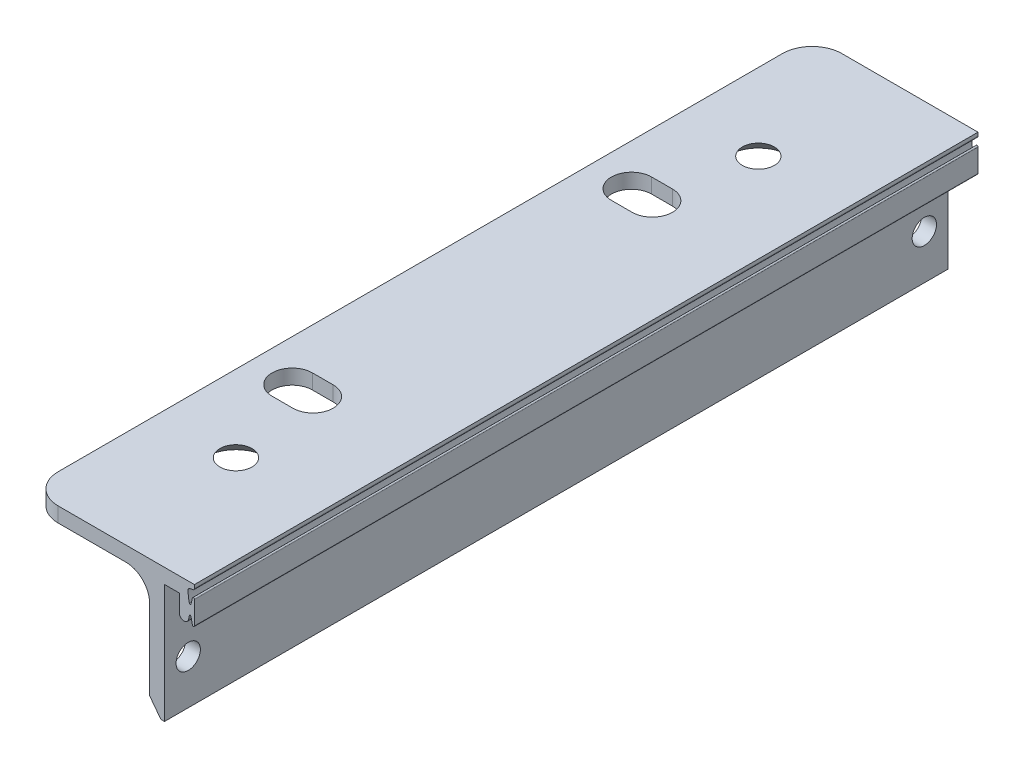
ISO-10303-21;
HEADER;
FILE_DESCRIPTION(('STEP AP214'),'2;1');
FILE_NAME('part.step','',(''),(''),'','','');
FILE_SCHEMA(('AUTOMOTIVE_DESIGN { 1 0 10303 214 1 1 1 1 }'));
ENDSEC;
DATA;
#1=APPLICATION_CONTEXT('core data for automotive mechanical design processes');
#2=APPLICATION_PROTOCOL_DEFINITION('international standard','automotive_design',2000,#1);
#3=PRODUCT_CONTEXT('',#1,'mechanical');
#4=PRODUCT('Part','Part','',(#3));
#5=PRODUCT_RELATED_PRODUCT_CATEGORY('part','',(#4));
#6=PRODUCT_DEFINITION_FORMATION('','',#4);
#7=PRODUCT_DEFINITION_CONTEXT('part definition',#1,'design');
#8=PRODUCT_DEFINITION('design','',#6,#7);
#9=PRODUCT_DEFINITION_SHAPE('','',#8);
#10=(LENGTH_UNIT() NAMED_UNIT(*) SI_UNIT(.MILLI.,.METRE.));
#11=(NAMED_UNIT(*) PLANE_ANGLE_UNIT() SI_UNIT($,.RADIAN.));
#12=(NAMED_UNIT(*) SI_UNIT($,.STERADIAN.) SOLID_ANGLE_UNIT());
#13=UNCERTAINTY_MEASURE_WITH_UNIT(LENGTH_MEASURE(1.E-05),#10,'distance_accuracy_value','');
#14=(GEOMETRIC_REPRESENTATION_CONTEXT(3) GLOBAL_UNCERTAINTY_ASSIGNED_CONTEXT((#13)) GLOBAL_UNIT_ASSIGNED_CONTEXT((#10,
#11,#12)) REPRESENTATION_CONTEXT('',''));
#15=CARTESIAN_POINT('',(0.,0.,0.));
#16=DIRECTION('',(0.,0.,1.));
#17=DIRECTION('',(1.,0.,0.));
#18=AXIS2_PLACEMENT_3D('',#15,#16,#17);
#19=CARTESIAN_POINT('',(2329.98403514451,-3290.10376988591,66.));
#20=DIRECTION('',(0.,-1.,0.));
#21=DIRECTION('',(1.,0.,0.));
#22=AXIS2_PLACEMENT_3D('',#19,#20,#21);
#23=PLANE('',#22);
#24=CARTESIAN_POINT('',(2342.92416485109,-3290.10376988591,44.));
#25=DIRECTION('',(0.,-1.,0.));
#26=DIRECTION('',(1.,0.,0.));
#27=AXIS2_PLACEMENT_3D('',#24,#25,#26);
#28=CIRCLE('',#27,2.70000000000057);
#29=CARTESIAN_POINT('',(2345.62416485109,-3290.10376988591,44.));
#30=VERTEX_POINT('',#29);
#31=EDGE_CURVE('E553',#30,#30,#28,.T.);
#32=ORIENTED_EDGE('',*,*,#31,.T.);
#33=EDGE_LOOP('',(#32));
#34=FACE_BOUND('',#33,.T.);
#35=DIRECTION('',(-1.,0.,0.));
#36=VECTOR('',#35,1.);
#37=CARTESIAN_POINT('',(2329.98403514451,-3290.10376988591,-66.));
#38=LINE('',#37,#36);
#39=CARTESIAN_POINT('',(2357.92403514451,-3290.10376988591,-66.));
#40=VERTEX_POINT('',#39);
#41=CARTESIAN_POINT('',(2334.98403514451,-3290.10376988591,-66.));
#42=VERTEX_POINT('',#41);
#43=EDGE_CURVE('E370',#40,#42,#38,.T.);
#44=ORIENTED_EDGE('',*,*,#43,.T.);
#45=CARTESIAN_POINT('',(2334.98403514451,-3290.10376988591,-61.));
#46=DIRECTION('',(0.,-1.,0.));
#47=DIRECTION('',(1.,0.,0.));
#48=AXIS2_PLACEMENT_3D('',#45,#46,#47);
#49=CIRCLE('',#48,5.);
#50=CARTESIAN_POINT('',(2329.98403514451,-3290.10376988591,-61.));
#51=VERTEX_POINT('',#50);
#52=EDGE_CURVE('E543',#42,#51,#49,.F.);
#53=ORIENTED_EDGE('',*,*,#52,.T.);
#54=DIRECTION('',(0.,0.,-1.));
#55=VECTOR('',#54,1.);
#56=CARTESIAN_POINT('',(2329.98403514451,-3290.10376988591,66.));
#57=LINE('',#56,#55);
#58=CARTESIAN_POINT('',(2329.98403514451,-3290.10376988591,61.));
#59=VERTEX_POINT('',#58);
#60=EDGE_CURVE('E413',#59,#51,#57,.T.);
#61=ORIENTED_EDGE('',*,*,#60,.F.);
#62=CARTESIAN_POINT('',(2334.98403514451,-3290.10376988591,61.));
#63=DIRECTION('',(0.,-1.,0.));
#64=DIRECTION('',(1.,0.,0.));
#65=AXIS2_PLACEMENT_3D('',#62,#63,#64);
#66=CIRCLE('',#65,5.);
#67=CARTESIAN_POINT('',(2334.98403514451,-3290.10376988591,66.));
#68=VERTEX_POINT('',#67);
#69=EDGE_CURVE('E541',#59,#68,#66,.F.);
#70=ORIENTED_EDGE('',*,*,#69,.T.);
#71=DIRECTION('',(-1.,0.,0.));
#72=VECTOR('',#71,1.);
#73=CARTESIAN_POINT('',(2329.98403514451,-3290.10376988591,66.));
#74=LINE('',#73,#72);
#75=CARTESIAN_POINT('',(2357.92403514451,-3290.10376988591,66.));
#76=VERTEX_POINT('',#75);
#77=EDGE_CURVE('E410',#76,#68,#74,.T.);
#78=ORIENTED_EDGE('',*,*,#77,.F.);
#79=DIRECTION('',(0.,0.,-1.));
#80=VECTOR('',#79,1.);
#81=CARTESIAN_POINT('',(2357.92403514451,-3290.10376988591,66.));
#82=LINE('',#81,#80);
#83=EDGE_CURVE('E459',#76,#40,#82,.T.);
#84=ORIENTED_EDGE('',*,*,#83,.T.);
#85=EDGE_LOOP('',(#44,#53,#61,#70,#78,#84));
#86=FACE_BOUND('',#85,.T.);
#87=DIRECTION('',(1.,0.,0.));
#88=VECTOR('',#87,1.);
#89=CARTESIAN_POINT('',(2340.48403514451,-3290.10376988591,-25.1750000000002));
#90=LINE('',#89,#88);
#91=CARTESIAN_POINT('',(2336.98403514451,-3290.10376988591,-25.1750000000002));
#92=VERTEX_POINT('',#91);
#93=CARTESIAN_POINT('',(2340.48403514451,-3290.10376988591,-25.1750000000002));
#94=VERTEX_POINT('',#93);
#95=EDGE_CURVE('E336',#92,#94,#90,.T.);
#96=ORIENTED_EDGE('',*,*,#95,.F.);
#97=CARTESIAN_POINT('',(2336.98403514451,-3290.10376988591,-28.575));
#98=DIRECTION('',(0.,1.,0.));
#99=DIRECTION('',(-1.,0.,0.));
#100=AXIS2_PLACEMENT_3D('',#97,#98,#99);
#101=CIRCLE('',#100,3.39999999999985);
#102=CARTESIAN_POINT('',(2336.98403514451,-3290.10376988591,-31.9749999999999));
#103=VERTEX_POINT('',#102);
#104=EDGE_CURVE('E334',#103,#92,#101,.T.);
#105=ORIENTED_EDGE('',*,*,#104,.F.);
#106=DIRECTION('',(-1.,0.,0.));
#107=VECTOR('',#106,1.);
#108=CARTESIAN_POINT('',(2340.48403514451,-3290.10376988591,-31.9749999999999));
#109=LINE('',#108,#107);
#110=CARTESIAN_POINT('',(2340.48403514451,-3290.10376988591,-31.9749999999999));
#111=VERTEX_POINT('',#110);
#112=EDGE_CURVE('E342',#111,#103,#109,.T.);
#113=ORIENTED_EDGE('',*,*,#112,.F.);
#114=CARTESIAN_POINT('',(2340.48403514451,-3290.10376988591,-28.575));
#115=DIRECTION('',(0.,1.,0.));
#116=DIRECTION('',(-1.,0.,0.));
#117=AXIS2_PLACEMENT_3D('',#114,#115,#116);
#118=CIRCLE('',#117,3.39999999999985);
#119=EDGE_CURVE('E339',#94,#111,#118,.T.);
#120=ORIENTED_EDGE('',*,*,#119,.F.);
#121=EDGE_LOOP('',(#96,#105,#113,#120));
#122=FACE_BOUND('',#121,.T.);
#123=DIRECTION('',(-1.,0.,0.));
#124=VECTOR('',#123,1.);
#125=CARTESIAN_POINT('',(2340.48403514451,-3290.10376988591,25.1750000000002));
#126=LINE('',#125,#124);
#127=CARTESIAN_POINT('',(2340.48403514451,-3290.10376988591,25.1750000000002));
#128=VERTEX_POINT('',#127);
#129=CARTESIAN_POINT('',(2336.98403514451,-3290.10376988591,25.1750000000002));
#130=VERTEX_POINT('',#129);
#131=EDGE_CURVE('E307',#128,#130,#126,.T.);
#132=ORIENTED_EDGE('',*,*,#131,.F.);
#133=CARTESIAN_POINT('',(2340.48403514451,-3290.10376988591,28.575));
#134=DIRECTION('',(0.,1.,0.));
#135=DIRECTION('',(1.,0.,0.));
#136=AXIS2_PLACEMENT_3D('',#133,#134,#135);
#137=CIRCLE('',#136,3.39999999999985);
#138=CARTESIAN_POINT('',(2340.48403514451,-3290.10376988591,31.9749999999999));
#139=VERTEX_POINT('',#138);
#140=EDGE_CURVE('E312',#139,#128,#137,.T.);
#141=ORIENTED_EDGE('',*,*,#140,.F.);
#142=DIRECTION('',(1.,0.,0.));
#143=VECTOR('',#142,1.);
#144=CARTESIAN_POINT('',(2340.48403514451,-3290.10376988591,31.9749999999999));
#145=LINE('',#144,#143);
#146=CARTESIAN_POINT('',(2336.98403514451,-3290.10376988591,31.9749999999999));
#147=VERTEX_POINT('',#146);
#148=EDGE_CURVE('E316',#147,#139,#145,.T.);
#149=ORIENTED_EDGE('',*,*,#148,.F.);
#150=CARTESIAN_POINT('',(2336.98403514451,-3290.10376988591,28.575));
#151=DIRECTION('',(0.,1.,0.));
#152=DIRECTION('',(1.,0.,0.));
#153=AXIS2_PLACEMENT_3D('',#150,#151,#152);
#154=CIRCLE('',#153,3.39999999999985);
#155=EDGE_CURVE('E296',#130,#147,#154,.T.);
#156=ORIENTED_EDGE('',*,*,#155,.F.);
#157=EDGE_LOOP('',(#132,#141,#149,#156));
#158=FACE_BOUND('',#157,.T.);
#159=CARTESIAN_POINT('',(2342.92416485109,-3290.10376988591,-44.));
#160=DIRECTION('',(0.,-1.,0.));
#161=DIRECTION('',(1.,0.,0.));
#162=AXIS2_PLACEMENT_3D('',#159,#160,#161);
#163=CIRCLE('',#162,2.70000000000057);
#164=CARTESIAN_POINT('',(2345.62416485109,-3290.10376988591,-44.));
#165=VERTEX_POINT('',#164);
#166=EDGE_CURVE('E549',#165,#165,#163,.T.);
#167=ORIENTED_EDGE('',*,*,#166,.T.);
#168=EDGE_LOOP('',(#167));
#169=FACE_BOUND('',#168,.T.);
#170=ADVANCED_FACE('F39',(#34,#86,#122,#158,#169),#23,.F.);
#171=CARTESIAN_POINT('',(2329.98403514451,-3290.10376988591,66.));
#172=DIRECTION('',(1.,0.,0.));
#173=DIRECTION('',(0.,0.,-1.));
#174=AXIS2_PLACEMENT_3D('',#171,#172,#173);
#175=PLANE('',#174);
#176=ORIENTED_EDGE('',*,*,#60,.T.);
#177=DIRECTION('',(0.,-1.,0.));
#178=VECTOR('',#177,1.);
#179=CARTESIAN_POINT('',(2329.98403514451,-3290.10376988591,-61.));
#180=LINE('',#179,#178);
#181=CARTESIAN_POINT('',(2329.98403514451,-3292.60376988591,-61.));
#182=VERTEX_POINT('',#181);
#183=EDGE_CURVE('E532',#51,#182,#180,.T.);
#184=ORIENTED_EDGE('',*,*,#183,.T.);
#185=DIRECTION('',(0.,0.,-1.));
#186=VECTOR('',#185,1.);
#187=CARTESIAN_POINT('',(2329.98403514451,-3292.60376988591,66.));
#188=LINE('',#187,#186);
#189=CARTESIAN_POINT('',(2329.98403514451,-3292.60376988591,61.));
#190=VERTEX_POINT('',#189);
#191=EDGE_CURVE('E519',#190,#182,#188,.T.);
#192=ORIENTED_EDGE('',*,*,#191,.F.);
#193=DIRECTION('',(0.,-1.,0.));
#194=VECTOR('',#193,1.);
#195=CARTESIAN_POINT('',(2329.98403514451,-3290.10376988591,61.));
#196=LINE('',#195,#194);
#197=EDGE_CURVE('E522',#190,#59,#196,.F.);
#198=ORIENTED_EDGE('',*,*,#197,.T.);
#199=EDGE_LOOP('',(#176,#184,#192,#198));
#200=FACE_BOUND('',#199,.T.);
#201=ADVANCED_FACE('F636',(#200),#175,.F.);
#202=CARTESIAN_POINT('',(2329.98403514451,-3292.60376988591,66.));
#203=DIRECTION('',(0.,1.,0.));
#204=DIRECTION('',(0.,0.,1.));
#205=AXIS2_PLACEMENT_3D('',#202,#203,#204);
#206=PLANE('',#205);
#207=DIRECTION('',(1.,0.,0.));
#208=VECTOR('',#207,1.);
#209=CARTESIAN_POINT('',(2329.98403514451,-3292.60376988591,-66.));
#210=LINE('',#209,#208);
#211=CARTESIAN_POINT('',(2334.98403514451,-3292.60376988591,-66.));
#212=VERTEX_POINT('',#211);
#213=CARTESIAN_POINT('',(2346.3840351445,-3292.60376988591,-66.));
#214=VERTEX_POINT('',#213);
#215=EDGE_CURVE('E366',#212,#214,#210,.T.);
#216=ORIENTED_EDGE('',*,*,#215,.T.);
#217=DIRECTION('',(0.,0.,-1.));
#218=VECTOR('',#217,1.);
#219=CARTESIAN_POINT('',(2346.3840351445,-3292.60376988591,66.));
#220=LINE('',#219,#218);
#221=CARTESIAN_POINT('',(2346.3840351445,-3292.60376988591,-47.8819193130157));
#222=VERTEX_POINT('',#221);
#223=EDGE_CURVE('E753',#214,#222,#220,.F.);
#224=ORIENTED_EDGE('',*,*,#223,.T.);
#225=CARTESIAN_POINT('',(2342.92416485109,-3292.60376988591,-44.));
#226=DIRECTION('',(0.,-1.,0.));
#227=DIRECTION('',(0.,0.,-1.));
#228=AXIS2_PLACEMENT_3D('',#225,#226,#227);
#229=CIRCLE('',#228,5.19999999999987);
#230=CARTESIAN_POINT('',(2346.3840351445,-3292.60376988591,-40.1180806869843));
#231=VERTEX_POINT('',#230);
#232=EDGE_CURVE('E556',#231,#222,#229,.T.);
#233=ORIENTED_EDGE('',*,*,#232,.F.);
#234=DIRECTION('',(0.,0.,-1.));
#235=VECTOR('',#234,1.);
#236=CARTESIAN_POINT('',(2346.3840351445,-3292.60376988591,66.));
#237=LINE('',#236,#235);
#238=CARTESIAN_POINT('',(2346.3840351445,-3292.60376988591,40.1180806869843));
#239=VERTEX_POINT('',#238);
#240=EDGE_CURVE('E755',#231,#239,#237,.F.);
#241=ORIENTED_EDGE('',*,*,#240,.T.);
#242=CARTESIAN_POINT('',(2342.92416485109,-3292.60376988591,44.));
#243=DIRECTION('',(0.,-1.,0.));
#244=DIRECTION('',(0.,0.,-1.));
#245=AXIS2_PLACEMENT_3D('',#242,#243,#244);
#246=CIRCLE('',#245,5.19999999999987);
#247=CARTESIAN_POINT('',(2346.3840351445,-3292.60376988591,47.8819193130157));
#248=VERTEX_POINT('',#247);
#249=EDGE_CURVE('E604',#248,#239,#246,.T.);
#250=ORIENTED_EDGE('',*,*,#249,.F.);
#251=DIRECTION('',(0.,0.,-1.));
#252=VECTOR('',#251,1.);
#253=CARTESIAN_POINT('',(2346.3840351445,-3292.60376988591,66.));
#254=LINE('',#253,#252);
#255=CARTESIAN_POINT('',(2346.3840351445,-3292.60376988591,66.));
#256=VERTEX_POINT('',#255);
#257=EDGE_CURVE('E60',#248,#256,#254,.F.);
#258=ORIENTED_EDGE('',*,*,#257,.T.);
#259=DIRECTION('',(1.,0.,0.));
#260=VECTOR('',#259,1.);
#261=CARTESIAN_POINT('',(2329.98403514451,-3292.60376988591,66.));
#262=LINE('',#261,#260);
#263=CARTESIAN_POINT('',(2334.98403514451,-3292.60376988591,66.));
#264=VERTEX_POINT('',#263);
#265=EDGE_CURVE('E367',#264,#256,#262,.T.);
#266=ORIENTED_EDGE('',*,*,#265,.F.);
#267=CARTESIAN_POINT('',(2334.98403514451,-3292.60376988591,61.));
#268=DIRECTION('',(0.,1.,0.));
#269=DIRECTION('',(0.,0.,1.));
#270=AXIS2_PLACEMENT_3D('',#267,#268,#269);
#271=CIRCLE('',#270,5.);
#272=EDGE_CURVE('E535',#264,#190,#271,.F.);
#273=ORIENTED_EDGE('',*,*,#272,.T.);
#274=ORIENTED_EDGE('',*,*,#191,.T.);
#275=CARTESIAN_POINT('',(2334.98403514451,-3292.60376988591,-61.));
#276=DIRECTION('',(0.,1.,0.));
#277=DIRECTION('',(0.,0.,1.));
#278=AXIS2_PLACEMENT_3D('',#275,#276,#277);
#279=CIRCLE('',#278,5.);
#280=EDGE_CURVE('E537',#182,#212,#279,.F.);
#281=ORIENTED_EDGE('',*,*,#280,.T.);
#282=EDGE_LOOP('',(#216,#224,#233,#241,#250,#258,#266,#273,#274,#281));
#283=FACE_BOUND('',#282,.T.);
#284=DIRECTION('',(1.,0.,0.));
#285=VECTOR('',#284,1.);
#286=CARTESIAN_POINT('',(2329.98403514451,-3292.60376988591,31.9749999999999));
#287=LINE('',#286,#285);
#288=CARTESIAN_POINT('',(2336.98403514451,-3292.60376988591,31.9749999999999));
#289=VERTEX_POINT('',#288);
#290=CARTESIAN_POINT('',(2340.48403514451,-3292.60376988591,31.9749999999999));
#291=VERTEX_POINT('',#290);
#292=EDGE_CURVE('E328',#289,#291,#287,.T.);
#293=ORIENTED_EDGE('',*,*,#292,.T.);
#294=CARTESIAN_POINT('',(2340.48403514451,-3292.60376988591,28.575));
#295=DIRECTION('',(0.,1.,0.));
#296=DIRECTION('',(0.,0.,1.));
#297=AXIS2_PLACEMENT_3D('',#294,#295,#296);
#298=CIRCLE('',#297,3.39999999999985);
#299=CARTESIAN_POINT('',(2340.48403514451,-3292.60376988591,25.1750000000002));
#300=VERTEX_POINT('',#299);
#301=EDGE_CURVE('E331',#291,#300,#298,.T.);
#302=ORIENTED_EDGE('',*,*,#301,.T.);
#303=DIRECTION('',(-1.,0.,0.));
#304=VECTOR('',#303,1.);
#305=CARTESIAN_POINT('',(2329.98403514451,-3292.60376988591,25.1750000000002));
#306=LINE('',#305,#304);
#307=CARTESIAN_POINT('',(2336.98403514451,-3292.60376988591,25.1750000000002));
#308=VERTEX_POINT('',#307);
#309=EDGE_CURVE('E323',#300,#308,#306,.T.);
#310=ORIENTED_EDGE('',*,*,#309,.T.);
#311=CARTESIAN_POINT('',(2336.98403514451,-3292.60376988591,28.575));
#312=DIRECTION('',(0.,1.,0.));
#313=DIRECTION('',(0.,0.,1.));
#314=AXIS2_PLACEMENT_3D('',#311,#312,#313);
#315=CIRCLE('',#314,3.39999999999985);
#316=EDGE_CURVE('E299',#308,#289,#315,.T.);
#317=ORIENTED_EDGE('',*,*,#316,.T.);
#318=EDGE_LOOP('',(#293,#302,#310,#317));
#319=FACE_BOUND('',#318,.T.);
#320=DIRECTION('',(-1.,0.,0.));
#321=VECTOR('',#320,1.);
#322=CARTESIAN_POINT('',(2329.98403514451,-3292.60376988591,-31.9749999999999));
#323=LINE('',#322,#321);
#324=CARTESIAN_POINT('',(2340.48403514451,-3292.60376988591,-31.9749999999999));
#325=VERTEX_POINT('',#324);
#326=CARTESIAN_POINT('',(2336.98403514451,-3292.60376988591,-31.9749999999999));
#327=VERTEX_POINT('',#326);
#328=EDGE_CURVE('E360',#325,#327,#323,.T.);
#329=ORIENTED_EDGE('',*,*,#328,.T.);
#330=CARTESIAN_POINT('',(2336.98403514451,-3292.60376988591,-28.575));
#331=DIRECTION('',(0.,1.,0.));
#332=DIRECTION('',(0.,0.,1.));
#333=AXIS2_PLACEMENT_3D('',#330,#331,#332);
#334=CIRCLE('',#333,3.39999999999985);
#335=CARTESIAN_POINT('',(2336.98403514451,-3292.60376988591,-25.1750000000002));
#336=VERTEX_POINT('',#335);
#337=EDGE_CURVE('E363',#327,#336,#334,.T.);
#338=ORIENTED_EDGE('',*,*,#337,.T.);
#339=DIRECTION('',(1.,0.,0.));
#340=VECTOR('',#339,1.);
#341=CARTESIAN_POINT('',(2329.98403514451,-3292.60376988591,-25.1750000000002));
#342=LINE('',#341,#340);
#343=CARTESIAN_POINT('',(2340.48403514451,-3292.60376988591,-25.1750000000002));
#344=VERTEX_POINT('',#343);
#345=EDGE_CURVE('E348',#336,#344,#342,.T.);
#346=ORIENTED_EDGE('',*,*,#345,.T.);
#347=CARTESIAN_POINT('',(2340.48403514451,-3292.60376988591,-28.575));
#348=DIRECTION('',(0.,1.,0.));
#349=DIRECTION('',(0.,0.,1.));
#350=AXIS2_PLACEMENT_3D('',#347,#348,#349);
#351=CIRCLE('',#350,3.39999999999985);
#352=EDGE_CURVE('E357',#344,#325,#351,.T.);
#353=ORIENTED_EDGE('',*,*,#352,.T.);
#354=EDGE_LOOP('',(#329,#338,#346,#353));
#355=FACE_BOUND('',#354,.T.);
#356=ADVANCED_FACE('F592',(#283,#319,#355),#206,.F.);
#357=CARTESIAN_POINT('',(2350.3840351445,-3292.60376988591,66.));
#358=DIRECTION('',(1.,0.,0.));
#359=DIRECTION('',(0.,0.,-1.));
#360=AXIS2_PLACEMENT_3D('',#357,#358,#359);
#361=PLANE('',#360);
#362=CARTESIAN_POINT('',(2350.38403514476,-3305.10376988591,62.));
#363=DIRECTION('',(-1.,0.,0.));
#364=DIRECTION('',(0.,1.,0.));
#365=AXIS2_PLACEMENT_3D('',#362,#363,#364);
#366=CIRCLE('',#365,2.0499999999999);
#367=CARTESIAN_POINT('',(2350.38403514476,-3307.15376988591,62.));
#368=VERTEX_POINT('',#367);
#369=EDGE_CURVE('E530',#368,#368,#366,.T.);
#370=ORIENTED_EDGE('',*,*,#369,.F.);
#371=EDGE_LOOP('',(#370));
#372=FACE_BOUND('',#371,.T.);
#373=CARTESIAN_POINT('',(2350.38403514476,-3305.10376988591,-62.));
#374=DIRECTION('',(-1.,0.,0.));
#375=DIRECTION('',(0.,-1.,0.));
#376=AXIS2_PLACEMENT_3D('',#373,#374,#375);
#377=CIRCLE('',#376,2.0499999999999);
#378=CARTESIAN_POINT('',(2350.38403514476,-3307.15376988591,-62.));
#379=VERTEX_POINT('',#378);
#380=EDGE_CURVE('E526',#379,#379,#377,.T.);
#381=ORIENTED_EDGE('',*,*,#380,.F.);
#382=EDGE_LOOP('',(#381));
#383=FACE_BOUND('',#382,.T.);
#384=DIRECTION('',(0.,-1.,0.));
#385=VECTOR('',#384,1.);
#386=CARTESIAN_POINT('',(2350.3840351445,-3292.60376988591,66.));
#387=LINE('',#386,#385);
#388=CARTESIAN_POINT('',(2350.3840351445,-3296.60376988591,66.));
#389=VERTEX_POINT('',#388);
#390=CARTESIAN_POINT('',(2350.3840351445,-3310.10376988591,66.));
#391=VERTEX_POINT('',#390);
#392=EDGE_CURVE('E369',#389,#391,#387,.T.);
#393=ORIENTED_EDGE('',*,*,#392,.F.);
#394=DIRECTION('',(0.,0.,-1.));
#395=VECTOR('',#394,1.);
#396=CARTESIAN_POINT('',(2350.3840351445,-3296.60376988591,-66.));
#397=LINE('',#396,#395);
#398=CARTESIAN_POINT('',(2350.3840351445,-3296.60376988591,47.8819193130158));
#399=VERTEX_POINT('',#398);
#400=EDGE_CURVE('E772',#389,#399,#397,.T.);
#401=ORIENTED_EDGE('',*,*,#400,.T.);
#402=CARTESIAN_POINT('',(2350.3840351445,-3296.3847202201,49.5091966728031));
#403=CARTESIAN_POINT('',(2350.3840351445,-3291.80961418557,48.1713901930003));
#404=CARTESIAN_POINT('',(2345.68970745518,-3292.60376988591,48.4036092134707));
#405=CARTESIAN_POINT('',(2350.3840351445,-3296.4304123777,49.3531096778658));
#406=CARTESIAN_POINT('',(2350.3840351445,-3291.87712415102,48.184180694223));
#407=CARTESIAN_POINT('',(2345.74584199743,-3292.60376988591,48.3682580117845));
#408=CARTESIAN_POINT('',(2350.3840351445,-3296.46832631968,49.1948890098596));
#409=CARTESIAN_POINT('',(2350.3840351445,-3291.95059176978,48.185894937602));
#410=CARTESIAN_POINT('',(2345.80559974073,-3292.60376988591,48.3293203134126));
#411=CARTESIAN_POINT('',(2350.3840351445,-3296.52967558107,48.8758975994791));
#412=CARTESIAN_POINT('',(2350.3840351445,-3292.1041660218,48.1643248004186));
#413=CARTESIAN_POINT('',(2345.93236087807,-3292.60376988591,48.2422750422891));
#414=CARTESIAN_POINT('',(2350.3840351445,-3296.55313316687,48.7151311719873));
#415=CARTESIAN_POINT('',(2350.3840351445,-3292.18401881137,48.1415415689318));
#416=CARTESIAN_POINT('',(2345.99935294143,-3292.60376988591,48.1941817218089));
#417=CARTESIAN_POINT('',(2350.3840351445,-3296.58641359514,48.3958059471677));
#418=CARTESIAN_POINT('',(2350.3840351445,-3292.34453034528,48.0704309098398));
#419=CARTESIAN_POINT('',(2346.13920802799,-3292.60376988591,48.0879071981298));
#420=CARTESIAN_POINT('',(2350.3840351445,-3296.59652349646,48.2372757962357));
#421=CARTESIAN_POINT('',(2350.3840351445,-3292.4249449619,48.0232050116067));
#422=CARTESIAN_POINT('',(2346.21191055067,-3292.60376988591,48.0299697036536));
#423=CARTESIAN_POINT('',(2350.3840351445,-3296.60550623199,47.9199397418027));
#424=CARTESIAN_POINT('',(2350.3840351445,-3292.5844107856,47.9032266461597));
#425=CARTESIAN_POINT('',(2346.36411787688,-3292.60376988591,47.9008606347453));
#426=CARTESIAN_POINT('',(2350.3840351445,-3296.60437982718,47.7611338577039));
#427=CARTESIAN_POINT('',(2350.3840351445,-3292.66339634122,47.8310328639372));
#428=CARTESIAN_POINT('',(2346.44362221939,-3292.60376988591,47.8296899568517));
#429=CARTESIAN_POINT('',(2350.3840351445,-3296.59351457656,47.46766998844));
#430=CARTESIAN_POINT('',(2350.3840351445,-3292.80539912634,47.6738987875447));
#431=CARTESIAN_POINT('',(2346.59625120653,-3292.60376988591,47.6830990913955));
#432=CARTESIAN_POINT('',(2350.3840351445,-3296.58509063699,47.3329569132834));
#433=CARTESIAN_POINT('',(2350.3840351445,-3292.86887532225,47.5930619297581));
#434=CARTESIAN_POINT('',(2346.6685484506,-3292.60376988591,47.6099110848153));
#435=CARTESIAN_POINT('',(2350.3840351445,-3296.56263759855,47.0639910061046));
#436=CARTESIAN_POINT('',(2350.3840351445,-3292.9907271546,47.4137108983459));
#437=CARTESIAN_POINT('',(2346.81651226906,-3292.60376988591,47.4498579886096));
#438=CARTESIAN_POINT('',(2350.3840351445,-3296.54860756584,46.9297382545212));
#439=CARTESIAN_POINT('',(2350.3840351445,-3293.04916732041,47.315518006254));
#440=CARTESIAN_POINT('',(2346.89217940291,-3292.60376988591,47.3629906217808));
#441=CARTESIAN_POINT('',(2350.3840351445,-3296.51634857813,46.6615021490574));
#442=CARTESIAN_POINT('',(2350.3840351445,-3293.15966196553,47.1020032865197));
#443=CARTESIAN_POINT('',(2347.04547033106,-3292.60376988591,47.1732851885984));
#444=CARTESIAN_POINT('',(2350.3840351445,-3296.49811186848,46.5275197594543));
#445=CARTESIAN_POINT('',(2350.3840351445,-3293.21181457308,46.9869233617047));
#446=CARTESIAN_POINT('',(2347.12309750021,-3292.60376988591,47.0704177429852));
#447=CARTESIAN_POINT('',(2350.3840351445,-3296.4591050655,46.2599384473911));
#448=CARTESIAN_POINT('',(2350.3840351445,-3293.30859681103,46.7407241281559));
#449=CARTESIAN_POINT('',(2347.27784192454,-3292.60376988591,46.8467493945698));
#450=CARTESIAN_POINT('',(2350.3840351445,-3296.43833502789,46.1263395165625));
#451=CARTESIAN_POINT('',(2350.3840351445,-3293.35336918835,46.6097986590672));
#452=CARTESIAN_POINT('',(2347.3549591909,-3292.60376988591,46.7259488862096));
#453=CARTESIAN_POINT('',(2350.3840351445,-3296.39619250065,45.8596220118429));
#454=CARTESIAN_POINT('',(2350.3840351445,-3293.43463444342,46.333500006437));
#455=CARTESIAN_POINT('',(2347.50519166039,-3292.60376988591,46.4651087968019));
#456=CARTESIAN_POINT('',(2350.3840351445,-3296.37482185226,45.7265031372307));
#457=CARTESIAN_POINT('',(2350.3840351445,-3293.47131093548,46.1882426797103));
#458=CARTESIAN_POINT('',(2347.57831742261,-3292.60376988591,46.3251237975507));
#459=CARTESIAN_POINT('',(2350.3840351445,-3296.33348704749,45.4600343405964));
#460=CARTESIAN_POINT('',(2350.38403514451,-3293.53623196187,45.8845675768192));
#461=CARTESIAN_POINT('',(2347.71652052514,-3292.60376988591,46.0249890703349));
#462=CARTESIAN_POINT('',(2350.3840351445,-3296.3135229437,45.3266844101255));
#463=CARTESIAN_POINT('',(2350.38403514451,-3293.56464298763,45.7260510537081));
#464=CARTESIAN_POINT('',(2347.78159756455,-3292.60376988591,45.8648385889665));
#465=CARTESIAN_POINT('',(2350.3840351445,-3296.27723767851,45.0598757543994));
#466=CARTESIAN_POINT('',(2350.3840351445,-3293.61291324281,45.3985599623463));
#467=CARTESIAN_POINT('',(2347.89841730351,-3292.60376988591,45.5260267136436));
#468=CARTESIAN_POINT('',(2350.3840351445,-3296.26090581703,44.926418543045));
#469=CARTESIAN_POINT('',(2350.3840351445,-3293.63294778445,45.2293217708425));
#470=CARTESIAN_POINT('',(2347.9501992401,-3292.60376988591,45.3474220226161));
#471=CARTESIAN_POINT('',(2350.3840351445,-3296.23385281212,44.6589314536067));
#472=CARTESIAN_POINT('',(2350.3840351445,-3293.66470545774,44.8830692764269));
#473=CARTESIAN_POINT('',(2348.03548176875,-3292.60376988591,44.9750999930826));
#474=CARTESIAN_POINT('',(2350.3840351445,-3296.22313080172,44.5249016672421));
#475=CARTESIAN_POINT('',(2350.3840351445,-3293.6765453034,44.7055404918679));
#476=CARTESIAN_POINT('',(2348.06898518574,-3292.60376988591,44.781384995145));
#477=CARTESIAN_POINT('',(2350.3840351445,-3296.20883274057,44.2569125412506));
#478=CARTESIAN_POINT('',(2350.3840351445,-3293.69206121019,44.3473529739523));
#479=CARTESIAN_POINT('',(2348.11359449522,-3292.60376988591,44.3862100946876));
#480=CARTESIAN_POINT('',(2350.3840351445,-3296.20523183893,44.1229545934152));
#481=CARTESIAN_POINT('',(2350.38403514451,-3293.69582725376,44.1660276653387));
#482=CARTESIAN_POINT('',(2348.12477827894,-3292.60376988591,44.1847796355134));
#483=CARTESIAN_POINT('',(2350.3840351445,-3296.20564311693,43.8550499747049));
#484=CARTESIAN_POINT('',(2350.3840351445,-3293.69539236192,43.804247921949));
#485=CARTESIAN_POINT('',(2348.12349888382,-3292.60376988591,43.7821625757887));
#486=CARTESIAN_POINT('',(2350.3840351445,-3296.20965535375,43.7211033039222));
#487=CARTESIAN_POINT('',(2350.3840351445,-3293.69118958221,43.6230486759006));
#488=CARTESIAN_POINT('',(2348.11103552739,-3292.60376988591,43.580975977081));
#489=CARTESIAN_POINT('',(2350.3840351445,-3296.22470810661,43.4533086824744));
#490=CARTESIAN_POINT('',(2350.3840351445,-3293.67480602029,43.2655475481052));
#491=CARTESIAN_POINT('',(2348.06405494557,-3292.60376988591,43.1869475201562));
#492=CARTESIAN_POINT('',(2350.3840351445,-3296.23576514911,43.3194617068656));
#493=CARTESIAN_POINT('',(2350.3840351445,-3293.66254135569,43.0885820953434));
#494=CARTESIAN_POINT('',(2348.02948586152,-3292.60376988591,42.9941264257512));
#495=CARTESIAN_POINT('',(2350.3840351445,-3296.26337551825,43.0523428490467));
#496=CARTESIAN_POINT('',(2350.3840351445,-3293.62994858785,42.7436042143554));
#497=CARTESIAN_POINT('',(2347.94237548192,-3292.60376988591,42.623835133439));
#498=CARTESIAN_POINT('',(2350.3840351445,-3296.27992961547,42.9190710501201));
#499=CARTESIAN_POINT('',(2350.3840351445,-3293.60950192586,42.5750899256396));
#500=CARTESIAN_POINT('',(2347.88983166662,-3292.60376988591,42.4463670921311));
#501=CARTESIAN_POINT('',(2350.3840351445,-3296.31658377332,42.6522959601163));
#502=CARTESIAN_POINT('',(2350.3840351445,-3293.56036407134,42.2487311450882));
#503=CARTESIAN_POINT('',(2347.77164819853,-3292.60376988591,42.1094950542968));
#504=CARTESIAN_POINT('',(2350.3840351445,-3296.33670264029,42.5187953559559));
#505=CARTESIAN_POINT('',(2350.3840351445,-3293.53147666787,42.0906666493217));
#506=CARTESIAN_POINT('',(2347.70593883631,-3292.60376988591,41.9501946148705));
#507=CARTESIAN_POINT('',(2350.3840351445,-3296.3782365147,42.2520043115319));
#508=CARTESIAN_POINT('',(2350.38403514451,-3293.46559110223,41.7880039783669));
#509=CARTESIAN_POINT('',(2347.56670175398,-3292.60376988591,41.6518099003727));
#510=CARTESIAN_POINT('',(2350.3840351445,-3296.39965151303,42.1187138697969));
#511=CARTESIAN_POINT('',(2350.3840351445,-3293.42842533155,41.6433171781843));
#512=CARTESIAN_POINT('',(2347.49317408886,-3292.60376988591,41.5127254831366));
#513=CARTESIAN_POINT('',(2350.3840351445,-3296.44169632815,41.8521207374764));
#514=CARTESIAN_POINT('',(2350.3840351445,-3293.3463361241,41.3687671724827));
#515=CARTESIAN_POINT('',(2347.34260818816,-3292.60376988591,41.2541400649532));
#516=CARTESIAN_POINT('',(2350.3840351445,-3296.46232679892,41.7188181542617));
#517=CARTESIAN_POINT('',(2350.3840351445,-3293.30125694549,41.2389664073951));
#518=CARTESIAN_POINT('',(2347.26557299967,-3292.60376988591,41.1346224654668));
#519=CARTESIAN_POINT('',(2350.3840351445,-3296.50097450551,41.4518398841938));
#520=CARTESIAN_POINT('',(2350.3840351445,-3293.20394270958,40.9950010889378));
#521=CARTESIAN_POINT('',(2347.11114232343,-3292.60376988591,40.9133494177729));
#522=CARTESIAN_POINT('',(2350.3840351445,-3296.51899199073,41.318164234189));
#523=CARTESIAN_POINT('',(2350.38403514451,-3293.15156816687,40.8810320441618));
#524=CARTESIAN_POINT('',(2347.03374687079,-3292.60376988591,40.8115922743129));
#525=CARTESIAN_POINT('',(2350.3840351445,-3296.5556968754,41.008854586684));
#526=CARTESIAN_POINT('',(2350.38403514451,-3293.02311175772,40.6361531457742));
#527=CARTESIAN_POINT('',(2346.85724038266,-3292.60376988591,40.5946912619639));
#528=CARTESIAN_POINT('',(2350.3840351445,-3296.57286815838,40.8330297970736));
#529=CARTESIAN_POINT('',(2350.3840351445,-3292.94493148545,40.512287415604));
#530=CARTESIAN_POINT('',(2346.75881599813,-3292.60376988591,40.4851399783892));
#531=CARTESIAN_POINT('',(2350.3840351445,-3296.59678385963,40.4806819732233));
#532=CARTESIAN_POINT('',(2350.3840351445,-3292.78101773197,40.2939241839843));
#533=CARTESIAN_POINT('',(2346.56850187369,-3292.60376988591,40.2881916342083));
#534=CARTESIAN_POINT('',(2350.3840351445,-3296.60353167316,40.3041591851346));
#535=CARTESIAN_POINT('',(2350.38403514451,-3292.69517843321,40.2001687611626));
#536=CARTESIAN_POINT('',(2346.47661001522,-3292.60376988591,40.2007873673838));
#537=CARTESIAN_POINT('',(2350.3840351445,-3296.6039962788,39.9504383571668));
#538=CARTESIAN_POINT('',(2350.38403514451,-3292.51958641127,40.0424495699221));
#539=CARTESIAN_POINT('',(2346.30062492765,-3292.60376988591,40.0435519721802));
#540=CARTESIAN_POINT('',(2350.3840351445,-3296.5976707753,39.7732399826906));
#541=CARTESIAN_POINT('',(2350.3840351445,-3292.42986307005,39.9793731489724));
#542=CARTESIAN_POINT('',(2346.2165579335,-3292.60376988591,39.9737787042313));
#543=CARTESIAN_POINT('',(2350.3840351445,-3296.57672639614,39.5081643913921));
#544=CARTESIAN_POINT('',(2350.38403514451,-3292.29677240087,39.9077333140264));
#545=CARTESIAN_POINT('',(2346.09697248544,-3292.60376988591,39.879824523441));
#546=CARTESIAN_POINT('',(2350.3840351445,-3296.56781780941,39.4198195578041));
#547=CARTESIAN_POINT('',(2350.3840351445,-3292.25228537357,39.8876207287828));
#548=CARTESIAN_POINT('',(2346.05815342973,-3292.60376988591,39.8502614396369));
#549=CARTESIAN_POINT('',(2350.3840351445,-3296.54594987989,39.2436031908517));
#550=CARTESIAN_POINT('',(2350.3840351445,-3292.164258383,39.8549322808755));
#551=CARTESIAN_POINT('',(2345.98271381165,-3292.60376988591,39.7943523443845));
#552=CARTESIAN_POINT('',(2350.3840351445,-3296.5329891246,39.1557318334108));
#553=CARTESIAN_POINT('',(2350.3840351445,-3292.12074889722,39.842445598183));
#554=CARTESIAN_POINT('',(2345.9460940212,-3292.60376988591,39.7680074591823));
#555=CARTESIAN_POINT('',(2350.3840351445,-3296.51789571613,39.0682079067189));
#556=CARTESIAN_POINT('',(2350.3840351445,-3292.07827929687,39.8336901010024));
#557=CARTESIAN_POINT('',(2345.9105792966,-3292.60376988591,39.7430845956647));
#558=(BOUNDED_SURFACE() B_SPLINE_SURFACE(3,2,((#402,#403,#404),(#405,#406,#407),(#408,#409,
#410),(#411,#412,#413),(#414,#415,#416),(#417,#418,#419),(#420,#421,#422),(#423,#424,#425),
(#426,#427,#428),(#429,#430,#431),(#432,#433,#434),(#435,#436,#437),(#438,#439,#440),(#441,#442,
#443),(#444,#445,#446),(#447,#448,#449),(#450,#451,#452),(#453,#454,#455),(#456,#457,#458),
(#459,#460,#461),(#462,#463,#464),(#465,#466,#467),(#468,#469,#470),(#471,#472,#473),(#474,#475,
#476),(#477,#478,#479),(#480,#481,#482),(#483,#484,#485),(#486,#487,#488),(#489,#490,#491),
(#492,#493,#494),(#495,#496,#497),(#498,#499,#500),(#501,#502,#503),(#504,#505,#506),(#507,#508,
#509),(#510,#511,#512),(#513,#514,#515),(#516,#517,#518),(#519,#520,#521),(#522,#523,#524),
(#525,#526,#527),(#528,#529,#530),(#531,#532,#533),(#534,#535,#536),(#537,#538,#539),(#540,#541,
#542),(#543,#544,#545),(#546,#547,#548),(#549,#550,#551),(#552,#553,#554),(#555,#556,#557)),
.UNSPECIFIED.,.F.,.F.,.F.) B_SPLINE_SURFACE_WITH_KNOTS((4,2,2,2,2,2,2,2,2,2,2,2,2,2,2,2,2,2,2,2,
2,2,2,2,2,4),(3,3),(0.,0.487516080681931,0.974279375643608,1.45039380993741,1.92647599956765,
2.33126841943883,2.73612829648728,3.14174054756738,3.54734387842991,3.95181629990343,
4.3563038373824,4.7595835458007,5.16280091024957,5.56460864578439,5.96641939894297,
6.36917625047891,6.77198958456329,7.17699496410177,7.58199749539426,7.98665466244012,
8.39127318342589,8.92102674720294,9.45060771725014,9.98190470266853,10.2481994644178,
10.5145871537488),(0.,1.),
.UNSPECIFIED.) GEOMETRIC_REPRESENTATION_ITEM() RATIONAL_B_SPLINE_SURFACE(((1.,0.642813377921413,
1.),(1.,0.648271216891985,1.),(1.,0.654011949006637,1.),(1.,0.66601554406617,1.),(1.,
0.672277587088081,1.),(1.,0.685154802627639,1.),(1.,0.691759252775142,1.),(1.,0.705376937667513,
1.),(1.,0.712390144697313,1.),(1.,0.725647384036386,1.),(1.,0.731849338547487,1.),(1.,
0.744378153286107,1.),(1.,0.750705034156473,1.),(1.,0.763360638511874,1.),(1.,0.769689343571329,
1.),(1.,0.782153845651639,1.),(1.,0.788289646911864,1.),(1.,0.800112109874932,1.),(1.,
0.80579997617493,1.),(1.,0.816449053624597,1.),(1.,0.821410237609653,1.),(1.,0.830251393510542,
1.),(1.,0.83413454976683,1.),(1.,0.840500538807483,1.),(1.,0.842983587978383,1.),(1.,
0.846284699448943,1.),(1.,0.847108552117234,1.),(1.,0.84701414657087,1.),(1.,0.846095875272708,
1.),(1.,0.842618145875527,1.),(1.,0.840054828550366,1.),(1.,0.833548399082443,1.),(1.,
0.829605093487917,1.),(1.,0.820653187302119,1.),(1.,0.815638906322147,1.),(1.,0.804898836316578,
1.),(1.,0.799173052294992,1.),(1.,0.787309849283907,1.),(1.,0.78117278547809,1.),(1.,
0.768717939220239,1.),(1.,0.762400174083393,1.),(1.,0.747809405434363,1.),(1.,0.739535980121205,
1.),(1.,0.723273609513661,1.),(1.,0.715284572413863,1.),(1.,0.699738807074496,1.),(1.,
0.692183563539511,1.),(1.,0.68127123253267,1.),(1.,0.677699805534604,1.),(1.,0.670706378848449,
1.),(1.,0.667284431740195,1.),(1.,0.663941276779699,1.))) REPRESENTATION_ITEM('') SURFACE());
#559=CARTESIAN_POINT('',(2350.3840351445,-3296.3847202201,49.5091966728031));
#560=CARTESIAN_POINT('',(2350.3840351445,-3296.4304123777,49.3531096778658));
#561=CARTESIAN_POINT('',(2350.3840351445,-3296.46832631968,49.1948890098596));
#562=CARTESIAN_POINT('',(2350.3840351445,-3296.52967558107,48.8758975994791));
#563=CARTESIAN_POINT('',(2350.3840351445,-3296.55313316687,48.7151311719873));
#564=CARTESIAN_POINT('',(2350.3840351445,-3296.58641359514,48.3958059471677));
#565=CARTESIAN_POINT('',(2350.3840351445,-3296.59652349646,48.2372757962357));
#566=CARTESIAN_POINT('',(2350.3840351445,-3296.60550623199,47.9199397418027));
#567=CARTESIAN_POINT('',(2350.3840351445,-3296.60437982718,47.7611338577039));
#568=CARTESIAN_POINT('',(2350.3840351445,-3296.59351457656,47.46766998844));
#569=CARTESIAN_POINT('',(2350.3840351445,-3296.58509063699,47.3329569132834));
#570=CARTESIAN_POINT('',(2350.3840351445,-3296.56263759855,47.0639910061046));
#571=CARTESIAN_POINT('',(2350.3840351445,-3296.54860756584,46.9297382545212));
#572=CARTESIAN_POINT('',(2350.3840351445,-3296.51634857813,46.6615021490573));
#573=CARTESIAN_POINT('',(2350.3840351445,-3296.49811186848,46.5275197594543));
#574=CARTESIAN_POINT('',(2350.3840351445,-3296.4591050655,46.2599384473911));
#575=CARTESIAN_POINT('',(2350.3840351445,-3296.43833502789,46.1263395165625));
#576=CARTESIAN_POINT('',(2350.3840351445,-3296.39619250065,45.8596220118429));
#577=CARTESIAN_POINT('',(2350.3840351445,-3296.37482185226,45.7265031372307));
#578=CARTESIAN_POINT('',(2350.3840351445,-3296.33348704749,45.4600343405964));
#579=CARTESIAN_POINT('',(2350.3840351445,-3296.3135229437,45.3266844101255));
#580=CARTESIAN_POINT('',(2350.3840351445,-3296.27723767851,45.0598757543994));
#581=CARTESIAN_POINT('',(2350.3840351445,-3296.26090581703,44.926418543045));
#582=CARTESIAN_POINT('',(2350.3840351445,-3296.23385281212,44.6589314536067));
#583=CARTESIAN_POINT('',(2350.3840351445,-3296.22313080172,44.5249016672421));
#584=CARTESIAN_POINT('',(2350.3840351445,-3296.20883274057,44.2569125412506));
#585=CARTESIAN_POINT('',(2350.3840351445,-3296.20523183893,44.1229545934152));
#586=CARTESIAN_POINT('',(2350.3840351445,-3296.20564311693,43.8550499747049));
#587=CARTESIAN_POINT('',(2350.3840351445,-3296.20965535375,43.7211033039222));
#588=CARTESIAN_POINT('',(2350.3840351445,-3296.22470810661,43.4533086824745));
#589=CARTESIAN_POINT('',(2350.3840351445,-3296.23576514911,43.3194617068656));
#590=CARTESIAN_POINT('',(2350.3840351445,-3296.26337551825,43.0523428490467));
#591=CARTESIAN_POINT('',(2350.3840351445,-3296.27992961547,42.9190710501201));
#592=CARTESIAN_POINT('',(2350.3840351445,-3296.31658377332,42.6522959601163));
#593=CARTESIAN_POINT('',(2350.3840351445,-3296.33670264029,42.5187953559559));
#594=CARTESIAN_POINT('',(2350.3840351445,-3296.3782365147,42.2520043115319));
#595=CARTESIAN_POINT('',(2350.3840351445,-3296.39965151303,42.1187138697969));
#596=CARTESIAN_POINT('',(2350.3840351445,-3296.44169632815,41.8521207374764));
#597=CARTESIAN_POINT('',(2350.3840351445,-3296.46232679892,41.7188181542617));
#598=CARTESIAN_POINT('',(2350.3840351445,-3296.50097450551,41.4518398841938));
#599=CARTESIAN_POINT('',(2350.3840351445,-3296.51899199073,41.318164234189));
#600=CARTESIAN_POINT('',(2350.3840351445,-3296.5556968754,41.008854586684));
#601=CARTESIAN_POINT('',(2350.3840351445,-3296.57286815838,40.8330297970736));
#602=CARTESIAN_POINT('',(2350.3840351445,-3296.59678385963,40.4806819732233));
#603=CARTESIAN_POINT('',(2350.3840351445,-3296.60353167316,40.3041591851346));
#604=CARTESIAN_POINT('',(2350.3840351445,-3296.6039962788,39.9504383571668));
#605=CARTESIAN_POINT('',(2350.3840351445,-3296.5976707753,39.7732399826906));
#606=CARTESIAN_POINT('',(2350.3840351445,-3296.57672639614,39.5081643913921));
#607=CARTESIAN_POINT('',(2350.3840351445,-3296.56781780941,39.4198195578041));
#608=CARTESIAN_POINT('',(2350.3840351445,-3296.54594987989,39.2436031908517));
#609=CARTESIAN_POINT('',(2350.3840351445,-3296.5329891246,39.1557318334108));
#610=CARTESIAN_POINT('',(2350.3840351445,-3296.51789571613,39.0682079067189));
#611=B_SPLINE_CURVE_WITH_KNOTS('',3,(#559,#560,#561,#562,#563,#564,#565,#566,#567,#568,#569,
#570,#571,#572,#573,#574,#575,#576,#577,#578,#579,#580,#581,#582,#583,#584,#585,#586,#587,#588,
#589,#590,#591,#592,#593,#594,#595,#596,#597,#598,#599,#600,#601,#602,#603,#604,#605,#606,#607,
#608,#609,#610),.UNSPECIFIED.,.F.,.F.,(4,2,2,2,2,2,2,2,2,2,2,2,2,2,2,2,2,2,2,2,2,2,2,2,2,4),(0.,
0.487516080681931,0.974279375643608,1.45039380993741,1.92647599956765,2.33126841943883,
2.73612829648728,3.14174054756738,3.54734387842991,3.95181629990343,4.3563038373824,
4.7595835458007,5.16280091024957,5.56460864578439,5.96641939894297,6.36917625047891,
6.77198958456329,7.17699496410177,7.58199749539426,7.98665466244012,8.39127318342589,
8.92102674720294,9.45060771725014,9.98190470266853,10.2481994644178,10.5145871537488),.UNSPECIFIED.);
#612=CARTESIAN_POINT('',(2350.3840351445,-3296.60376988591,40.1180806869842));
#613=VERTEX_POINT('',#612);
#614=EDGE_CURVE('E766',#399,#613,#611,.T.);
#615=ORIENTED_EDGE('',*,*,#614,.T.);
#616=DIRECTION('',(0.,0.,-1.));
#617=VECTOR('',#616,1.);
#618=CARTESIAN_POINT('',(2350.3840351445,-3296.60376988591,-66.));
#619=LINE('',#618,#617);
#620=CARTESIAN_POINT('',(2350.3840351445,-3296.60376988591,-40.1180806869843));
#621=VERTEX_POINT('',#620);
#622=EDGE_CURVE('E566',#613,#621,#619,.T.);
#623=ORIENTED_EDGE('',*,*,#622,.T.);
#624=CARTESIAN_POINT('',(2350.3840351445,-3296.3847202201,-38.4908033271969));
#625=CARTESIAN_POINT('',(2350.3840351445,-3291.80961418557,-39.8286098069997));
#626=CARTESIAN_POINT('',(2345.68970745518,-3292.60376988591,-39.5963907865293));
#627=CARTESIAN_POINT('',(2350.3840351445,-3296.4304123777,-38.6468903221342));
#628=CARTESIAN_POINT('',(2350.3840351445,-3291.87712415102,-39.8158193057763));
#629=CARTESIAN_POINT('',(2345.74584199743,-3292.60376988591,-39.6317419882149));
#630=CARTESIAN_POINT('',(2350.3840351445,-3296.46832631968,-38.8051109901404));
#631=CARTESIAN_POINT('',(2350.3840351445,-3291.95059176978,-39.8141050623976));
#632=CARTESIAN_POINT('',(2345.80559974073,-3292.60376988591,-39.6706796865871));
#633=CARTESIAN_POINT('',(2350.3840351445,-3296.52967558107,-39.1241024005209));
#634=CARTESIAN_POINT('',(2350.3840351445,-3292.10416602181,-39.8356751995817));
#635=CARTESIAN_POINT('',(2345.93236087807,-3292.60376988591,-39.7577249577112));
#636=CARTESIAN_POINT('',(2350.3840351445,-3296.55313316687,-39.2848688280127));
#637=CARTESIAN_POINT('',(2350.3840351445,-3292.18401881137,-39.8584584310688));
#638=CARTESIAN_POINT('',(2345.99935294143,-3292.60376988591,-39.8058182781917));
#639=CARTESIAN_POINT('',(2350.3840351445,-3296.58641359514,-39.6041940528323));
#640=CARTESIAN_POINT('',(2350.3840351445,-3292.34453034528,-39.9295690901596));
#641=CARTESIAN_POINT('',(2346.13920802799,-3292.60376988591,-39.9120928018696));
#642=CARTESIAN_POINT('',(2350.3840351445,-3296.59652349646,-39.7627242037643));
#643=CARTESIAN_POINT('',(2350.3840351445,-3292.4249449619,-39.9767949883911));
#644=CARTESIAN_POINT('',(2346.21191055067,-3292.60376988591,-39.9700302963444));
#645=CARTESIAN_POINT('',(2350.3840351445,-3296.60550623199,-40.0800602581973));
#646=CARTESIAN_POINT('',(2350.3840351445,-3292.58441078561,-40.0967733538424));
#647=CARTESIAN_POINT('',(2346.36411787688,-3292.60376988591,-40.0991393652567));
#648=CARTESIAN_POINT('',(2350.3840351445,-3296.60437982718,-40.2388661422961));
#649=CARTESIAN_POINT('',(2350.38403514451,-3292.66339634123,-40.1689671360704));
#650=CARTESIAN_POINT('',(2346.44362221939,-3292.60376988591,-40.1703100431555));
#651=CARTESIAN_POINT('',(2350.3840351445,-3296.59351457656,-40.5323300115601));
#652=CARTESIAN_POINT('',(2350.3840351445,-3292.80539912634,-40.326101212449));
#653=CARTESIAN_POINT('',(2346.59625120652,-3292.60376988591,-40.3169009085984));
#654=CARTESIAN_POINT('',(2350.3840351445,-3296.58509063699,-40.6670430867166));
#655=CARTESIAN_POINT('',(2350.3840351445,-3292.86887532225,-40.4069380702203));
#656=CARTESIAN_POINT('',(2346.66854845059,-3292.60376988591,-40.3900889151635));
#657=CARTESIAN_POINT('',(2350.3840351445,-3296.56263759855,-40.9360089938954));
#658=CARTESIAN_POINT('',(2350.3840351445,-3292.99072715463,-40.5862891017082));
#659=CARTESIAN_POINT('',(2346.8165122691,-3292.60376988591,-40.550142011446));
#660=CARTESIAN_POINT('',(2350.3840351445,-3296.54860756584,-41.0702617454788));
#661=CARTESIAN_POINT('',(2350.3840351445,-3293.04916732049,-40.684481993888));
#662=CARTESIAN_POINT('',(2346.89217940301,-3292.60376988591,-40.6370093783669));
#663=CARTESIAN_POINT('',(2350.3840351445,-3296.51634857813,-41.3384978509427));
#664=CARTESIAN_POINT('',(2350.38403514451,-3293.15966196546,-40.8979967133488));
#665=CARTESIAN_POINT('',(2347.04547033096,-3292.60376988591,-40.82671481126));
#666=CARTESIAN_POINT('',(2350.3840351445,-3296.49811186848,-41.4724802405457));
#667=CARTESIAN_POINT('',(2350.3840351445,-3293.21181457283,-41.0130766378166));
#668=CARTESIAN_POINT('',(2347.12309749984,-3292.60376988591,-40.9295822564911));
#669=CARTESIAN_POINT('',(2350.3840351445,-3296.4591050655,-41.7400615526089));
#670=CARTESIAN_POINT('',(2350.3840351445,-3293.30859681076,-41.2592758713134));
#671=CARTESIAN_POINT('',(2347.27784192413,-3292.60376988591,-41.1532506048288));
#672=CARTESIAN_POINT('',(2350.3840351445,-3296.43833502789,-41.8736604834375));
#673=CARTESIAN_POINT('',(2350.3840351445,-3293.35336918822,-41.3902013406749));
#674=CARTESIAN_POINT('',(2347.35495919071,-3292.60376988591,-41.2740511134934));
#675=CARTESIAN_POINT('',(2350.3840351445,-3296.39619250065,-42.1403779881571));
#676=CARTESIAN_POINT('',(2350.3840351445,-3293.43463444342,-41.6664999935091));
#677=CARTESIAN_POINT('',(2347.50519166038,-3292.60376988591,-41.534891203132));
#678=CARTESIAN_POINT('',(2350.3840351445,-3296.37482185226,-42.2734968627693));
#679=CARTESIAN_POINT('',(2350.3840351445,-3293.47131093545,-41.8117573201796));
#680=CARTESIAN_POINT('',(2347.57831742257,-3292.60376988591,-41.6748762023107));
#681=CARTESIAN_POINT('',(2350.3840351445,-3296.33348704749,-42.5399656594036));
#682=CARTESIAN_POINT('',(2350.3840351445,-3293.53623196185,-42.1154324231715));
#683=CARTESIAN_POINT('',(2347.71652052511,-3292.60376988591,-41.9750109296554));
#684=CARTESIAN_POINT('',(2350.3840351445,-3296.3135229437,-42.6733155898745));
#685=CARTESIAN_POINT('',(2350.3840351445,-3293.56464298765,-42.2739489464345));
#686=CARTESIAN_POINT('',(2347.78159756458,-3292.60376988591,-42.1351614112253));
#687=CARTESIAN_POINT('',(2350.3840351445,-3296.27723767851,-42.9401242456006));
#688=CARTESIAN_POINT('',(2350.3840351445,-3293.61291324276,-42.6014400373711));
#689=CARTESIAN_POINT('',(2347.89841730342,-3292.60376988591,-42.473973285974));
#690=CARTESIAN_POINT('',(2350.3840351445,-3296.26090581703,-43.073581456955));
#691=CARTESIAN_POINT('',(2350.3840351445,-3293.63294778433,-42.7706782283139));
#692=CARTESIAN_POINT('',(2347.95019923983,-3292.60376988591,-42.6525779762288));
#693=CARTESIAN_POINT('',(2350.3840351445,-3296.23385281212,-43.3410685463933));
#694=CARTESIAN_POINT('',(2350.38403514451,-3293.66470545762,-43.116930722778));
#695=CARTESIAN_POINT('',(2348.0354817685,-3292.60376988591,-43.0249000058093));
#696=CARTESIAN_POINT('',(2350.3840351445,-3296.22313080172,-43.4750983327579));
#697=CARTESIAN_POINT('',(2350.38403514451,-3293.67654530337,-43.2944595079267));
#698=CARTESIAN_POINT('',(2348.06898518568,-3292.60376988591,-43.2186150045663));
#699=CARTESIAN_POINT('',(2350.3840351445,-3296.20883274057,-43.7430874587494));
#700=CARTESIAN_POINT('',(2350.3840351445,-3293.69206121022,-43.6526470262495));
#701=CARTESIAN_POINT('',(2348.11359449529,-3292.60376988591,-43.6137899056));
#702=CARTESIAN_POINT('',(2350.3840351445,-3296.20523183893,-43.8770454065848));
#703=CARTESIAN_POINT('',(2350.3840351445,-3293.69582725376,-43.8339723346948));
#704=CARTESIAN_POINT('',(2348.12477827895,-3292.60376988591,-43.8152203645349));
#705=CARTESIAN_POINT('',(2350.3840351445,-3296.20564311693,-44.1449500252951));
#706=CARTESIAN_POINT('',(2350.3840351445,-3293.69539236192,-44.1957520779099));
#707=CARTESIAN_POINT('',(2348.12349888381,-3292.60376988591,-44.2178374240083));
#708=CARTESIAN_POINT('',(2350.3840351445,-3296.20965535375,-44.2788966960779));
#709=CARTESIAN_POINT('',(2350.3840351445,-3293.69118958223,-44.3769513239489));
#710=CARTESIAN_POINT('',(2348.11103552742,-3292.60376988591,-44.4190240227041));
#711=CARTESIAN_POINT('',(2350.3840351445,-3296.22470810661,-44.5466913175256));
#712=CARTESIAN_POINT('',(2350.3840351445,-3293.67480602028,-44.7344524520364));
#713=CARTESIAN_POINT('',(2348.06405494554,-3292.60376988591,-44.8130524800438));
#714=CARTESIAN_POINT('',(2350.3840351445,-3296.23576514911,-44.6805382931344));
#715=CARTESIAN_POINT('',(2350.3840351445,-3293.66254135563,-44.9114179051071));
#716=CARTESIAN_POINT('',(2348.02948586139,-3292.60376988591,-45.0058735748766));
#717=CARTESIAN_POINT('',(2350.3840351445,-3296.26337551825,-44.9476571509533));
#718=CARTESIAN_POINT('',(2350.3840351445,-3293.62994858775,-45.2563957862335));
#719=CARTESIAN_POINT('',(2347.94237548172,-3292.60376988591,-45.3761648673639));
#720=CARTESIAN_POINT('',(2350.3840351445,-3296.27992961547,-45.0809289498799));
#721=CARTESIAN_POINT('',(2350.3840351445,-3293.60950192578,-45.4249100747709));
#722=CARTESIAN_POINT('',(2347.88983166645,-3292.60376988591,-45.5536329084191));
#723=CARTESIAN_POINT('',(2350.3840351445,-3296.31658377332,-45.3477040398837));
#724=CARTESIAN_POINT('',(2350.3840351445,-3293.56036407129,-45.7512688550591));
#725=CARTESIAN_POINT('',(2347.77164819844,-3292.60376988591,-45.8905049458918));
#726=CARTESIAN_POINT('',(2350.3840351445,-3296.33670264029,-45.4812046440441));
#727=CARTESIAN_POINT('',(2350.3840351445,-3293.53147666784,-45.9093333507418));
#728=CARTESIAN_POINT('',(2347.70593883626,-3292.60376988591,-46.0498053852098));
#729=CARTESIAN_POINT('',(2350.3840351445,-3296.3782365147,-45.747995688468));
#730=CARTESIAN_POINT('',(2350.3840351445,-3293.46559110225,-46.2119960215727));
#731=CARTESIAN_POINT('',(2347.56670175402,-3292.60376988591,-46.3481900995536));
#732=CARTESIAN_POINT('',(2350.3840351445,-3296.39965151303,-45.881286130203));
#733=CARTESIAN_POINT('',(2350.3840351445,-3293.4284253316,-46.3566828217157));
#734=CARTESIAN_POINT('',(2347.49317408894,-3292.60376988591,-46.4872745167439));
#735=CARTESIAN_POINT('',(2350.3840351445,-3296.44169632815,-46.1478792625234));
#736=CARTESIAN_POINT('',(2350.3840351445,-3293.34633612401,-46.6312328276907));
#737=CARTESIAN_POINT('',(2347.34260818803,-3292.60376988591,-46.7458599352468));
#738=CARTESIAN_POINT('',(2350.3840351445,-3296.46232679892,-46.2811818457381));
#739=CARTESIAN_POINT('',(2350.3840351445,-3293.30125694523,-46.7610335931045));
#740=CARTESIAN_POINT('',(2347.26557299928,-3292.60376988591,-46.865377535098));
#741=CARTESIAN_POINT('',(2350.3840351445,-3296.50097450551,-46.5481601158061));
#742=CARTESIAN_POINT('',(2350.3840351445,-3293.20394270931,-47.0049989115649));
#743=CARTESIAN_POINT('',(2347.11114232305,-3292.60376988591,-47.0866505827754));
#744=CARTESIAN_POINT('',(2350.3840351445,-3296.51899199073,-46.681835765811));
#745=CARTESIAN_POINT('',(2350.3840351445,-3293.15156816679,-47.1189679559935));
#746=CARTESIAN_POINT('',(2347.03374687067,-3292.60376988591,-47.188407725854));
#747=CARTESIAN_POINT('',(2350.3840351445,-3296.5556968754,-46.991145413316));
#748=CARTESIAN_POINT('',(2350.3840351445,-3293.02311175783,-47.3638468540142));
#749=CARTESIAN_POINT('',(2346.85724038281,-3292.60376988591,-47.4053087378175));
#750=CARTESIAN_POINT('',(2350.3840351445,-3296.57286815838,-47.1669702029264));
#751=CARTESIAN_POINT('',(2350.3840351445,-3292.9449314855,-47.487712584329));
#752=CARTESIAN_POINT('',(2346.75881599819,-3292.60376988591,-47.5148600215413));
#753=CARTESIAN_POINT('',(2350.3840351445,-3296.59678385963,-47.5193180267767));
#754=CARTESIAN_POINT('',(2350.3840351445,-3292.78101773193,-47.7060758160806));
#755=CARTESIAN_POINT('',(2346.56850187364,-3292.60376988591,-47.7118083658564));
#756=CARTESIAN_POINT('',(2350.3840351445,-3296.60353167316,-47.6958408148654));
#757=CARTESIAN_POINT('',(2350.3840351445,-3292.69517843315,-47.7998312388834));
#758=CARTESIAN_POINT('',(2346.47661001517,-3292.60376988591,-47.7992126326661));
#759=CARTESIAN_POINT('',(2350.3840351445,-3296.6039962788,-48.0495616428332));
#760=CARTESIAN_POINT('',(2350.3840351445,-3292.51958641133,-47.9575504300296));
#761=CARTESIAN_POINT('',(2346.30062492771,-3292.60376988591,-47.9564480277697));
#762=CARTESIAN_POINT('',(2350.3840351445,-3296.5976707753,-48.2267600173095));
#763=CARTESIAN_POINT('',(2350.3840351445,-3292.42986307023,-48.0206268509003));
#764=CARTESIAN_POINT('',(2346.21655793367,-3292.60376988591,-48.026221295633));
#765=CARTESIAN_POINT('',(2350.3840351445,-3296.57672639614,-48.4918356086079));
#766=CARTESIAN_POINT('',(2350.3840351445,-3292.29677240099,-48.0922666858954));
#767=CARTESIAN_POINT('',(2346.09697248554,-3292.60376988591,-48.1201754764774));
#768=CARTESIAN_POINT('',(2350.3840351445,-3296.56781780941,-48.5801804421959));
#769=CARTESIAN_POINT('',(2350.3840351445,-3292.25228537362,-48.1123792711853));
#770=CARTESIAN_POINT('',(2346.05815342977,-3292.60376988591,-48.1497385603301));
#771=CARTESIAN_POINT('',(2350.3840351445,-3296.54594987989,-48.7563968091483));
#772=CARTESIAN_POINT('',(2350.3840351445,-3292.16425838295,-48.1450677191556));
#773=CARTESIAN_POINT('',(2345.98271381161,-3292.60376988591,-48.205647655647));
#774=CARTESIAN_POINT('',(2350.3840351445,-3296.5329891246,-48.8442681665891));
#775=CARTESIAN_POINT('',(2350.3840351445,-3292.12074889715,-48.1575544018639));
#776=CARTESIAN_POINT('',(2345.94609402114,-3292.60376988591,-48.2319925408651));
#777=CARTESIAN_POINT('',(2350.3840351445,-3296.51789571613,-48.9317920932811));
#778=CARTESIAN_POINT('',(2350.3840351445,-3292.07827929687,-48.1663098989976));
#779=CARTESIAN_POINT('',(2345.9105792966,-3292.60376988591,-48.2569154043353));
#780=(BOUNDED_SURFACE() B_SPLINE_SURFACE(3,2,((#624,#625,#626),(#627,#628,#629),(#630,#631,
#632),(#633,#634,#635),(#636,#637,#638),(#639,#640,#641),(#642,#643,#644),(#645,#646,#647),
(#648,#649,#650),(#651,#652,#653),(#654,#655,#656),(#657,#658,#659),(#660,#661,#662),(#663,#664,
#665),(#666,#667,#668),(#669,#670,#671),(#672,#673,#674),(#675,#676,#677),(#678,#679,#680),
(#681,#682,#683),(#684,#685,#686),(#687,#688,#689),(#690,#691,#692),(#693,#694,#695),(#696,#697,
#698),(#699,#700,#701),(#702,#703,#704),(#705,#706,#707),(#708,#709,#710),(#711,#712,#713),
(#714,#715,#716),(#717,#718,#719),(#720,#721,#722),(#723,#724,#725),(#726,#727,#728),(#729,#730,
#731),(#732,#733,#734),(#735,#736,#737),(#738,#739,#740),(#741,#742,#743),(#744,#745,#746),
(#747,#748,#749),(#750,#751,#752),(#753,#754,#755),(#756,#757,#758),(#759,#760,#761),(#762,#763,
#764),(#765,#766,#767),(#768,#769,#770),(#771,#772,#773),(#774,#775,#776),(#777,#778,#779)),
.UNSPECIFIED.,.F.,.F.,.F.) B_SPLINE_SURFACE_WITH_KNOTS((4,2,2,2,2,2,2,2,2,2,2,2,2,2,2,2,2,2,2,2,
2,2,2,2,2,4),(3,3),(0.,0.487516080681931,0.974279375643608,1.45039380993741,1.92647599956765,
2.33126841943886,2.73612829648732,3.14174054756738,3.54734387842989,3.95181629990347,
4.35630383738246,4.75958354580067,5.16280091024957,5.56460864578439,5.96641939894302,
6.36917625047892,6.77198958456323,7.17699496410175,7.58199749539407,7.98665466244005,
8.3912731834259,8.92102674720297,9.45060771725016,9.98190470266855,10.2481994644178,
10.5145871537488),(0.,1.),
.UNSPECIFIED.) GEOMETRIC_REPRESENTATION_ITEM() RATIONAL_B_SPLINE_SURFACE(((1.,0.642813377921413,
1.),(1.,0.648271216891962,1.),(1.,0.654011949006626,1.),(1.,0.666015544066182,1.),(1.,
0.672277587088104,1.),(1.,0.685154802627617,1.),(1.,0.691759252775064,1.),(1.,0.705376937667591,
1.),(1.,0.712390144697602,1.),(1.,0.72564738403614,1.),(1.,0.731849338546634,1.),(1.,
0.744378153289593,1.),(1.,0.750705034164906,1.),(1.,0.763360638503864,1.),(1.,0.769689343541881,
1.),(1.,0.782153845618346,1.),(1.,0.788289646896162,1.),(1.,0.800112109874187,1.),(1.,
0.805799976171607,1.),(1.,0.816449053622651,1.),(1.,0.821410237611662,1.),(1.,0.830251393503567,
1.),(1.,0.834134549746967,1.),(1.,0.840500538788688,1.),(1.,0.842983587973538,1.),(1.,
0.84628469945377,1.),(1.,0.847108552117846,1.),(1.,0.847014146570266,1.),(1.,0.846095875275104,
1.),(1.,0.842618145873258,1.),(1.,0.840054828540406,1.),(1.,0.833548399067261,1.),(1.,
0.829605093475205,1.),(1.,0.820653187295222,1.),(1.,0.815638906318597,1.),(1.,0.804898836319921,
1.),(1.,0.799173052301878,1.),(1.,0.787309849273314,1.),(1.,0.781172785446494,1.),(1.,
0.768717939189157,1.),(1.,0.762400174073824,1.),(1.,0.747809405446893,1.),(1.,0.739535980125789,
1.),(1.,0.723273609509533,1.),(1.,0.715284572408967,1.),(1.,0.699738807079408,1.),(1.,
0.692183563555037,1.),(1.,0.681271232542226,1.),(1.,0.677699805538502,1.),(1.,0.670706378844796,
1.),(1.,0.66728443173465,1.),(1.,0.663941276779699,1.))) REPRESENTATION_ITEM('') SURFACE());
#781=CARTESIAN_POINT('',(2350.3840351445,-3296.3847202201,-38.4908033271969));
#782=CARTESIAN_POINT('',(2350.3840351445,-3296.4304123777,-38.6468903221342));
#783=CARTESIAN_POINT('',(2350.3840351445,-3296.46832631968,-38.8051109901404));
#784=CARTESIAN_POINT('',(2350.3840351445,-3296.52967558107,-39.1241024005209));
#785=CARTESIAN_POINT('',(2350.3840351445,-3296.55313316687,-39.2848688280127));
#786=CARTESIAN_POINT('',(2350.3840351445,-3296.58641359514,-39.6041940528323));
#787=CARTESIAN_POINT('',(2350.3840351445,-3296.59652349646,-39.7627242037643));
#788=CARTESIAN_POINT('',(2350.3840351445,-3296.60550623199,-40.0800602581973));
#789=CARTESIAN_POINT('',(2350.3840351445,-3296.60437982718,-40.2388661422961));
#790=CARTESIAN_POINT('',(2350.3840351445,-3296.59351457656,-40.53233001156));
#791=CARTESIAN_POINT('',(2350.3840351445,-3296.58509063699,-40.6670430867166));
#792=CARTESIAN_POINT('',(2350.3840351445,-3296.56263759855,-40.9360089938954));
#793=CARTESIAN_POINT('',(2350.3840351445,-3296.54860756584,-41.0702617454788));
#794=CARTESIAN_POINT('',(2350.3840351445,-3296.51634857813,-41.3384978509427));
#795=CARTESIAN_POINT('',(2350.3840351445,-3296.49811186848,-41.4724802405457));
#796=CARTESIAN_POINT('',(2350.3840351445,-3296.4591050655,-41.7400615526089));
#797=CARTESIAN_POINT('',(2350.3840351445,-3296.43833502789,-41.8736604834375));
#798=CARTESIAN_POINT('',(2350.3840351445,-3296.39619250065,-42.1403779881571));
#799=CARTESIAN_POINT('',(2350.3840351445,-3296.37482185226,-42.2734968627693));
#800=CARTESIAN_POINT('',(2350.3840351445,-3296.33348704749,-42.5399656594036));
#801=CARTESIAN_POINT('',(2350.3840351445,-3296.3135229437,-42.6733155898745));
#802=CARTESIAN_POINT('',(2350.3840351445,-3296.27723767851,-42.9401242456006));
#803=CARTESIAN_POINT('',(2350.3840351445,-3296.26090581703,-43.073581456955));
#804=CARTESIAN_POINT('',(2350.3840351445,-3296.23385281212,-43.3410685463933));
#805=CARTESIAN_POINT('',(2350.3840351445,-3296.22313080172,-43.4750983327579));
#806=CARTESIAN_POINT('',(2350.3840351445,-3296.20883274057,-43.7430874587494));
#807=CARTESIAN_POINT('',(2350.3840351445,-3296.20523183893,-43.8770454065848));
#808=CARTESIAN_POINT('',(2350.3840351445,-3296.20564311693,-44.1449500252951));
#809=CARTESIAN_POINT('',(2350.3840351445,-3296.20965535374,-44.2788966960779));
#810=CARTESIAN_POINT('',(2350.3840351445,-3296.22470810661,-44.5466913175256));
#811=CARTESIAN_POINT('',(2350.3840351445,-3296.23576514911,-44.6805382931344));
#812=CARTESIAN_POINT('',(2350.3840351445,-3296.26337551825,-44.9476571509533));
#813=CARTESIAN_POINT('',(2350.3840351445,-3296.27992961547,-45.0809289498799));
#814=CARTESIAN_POINT('',(2350.3840351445,-3296.31658377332,-45.3477040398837));
#815=CARTESIAN_POINT('',(2350.3840351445,-3296.33670264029,-45.4812046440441));
#816=CARTESIAN_POINT('',(2350.3840351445,-3296.3782365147,-45.747995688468));
#817=CARTESIAN_POINT('',(2350.3840351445,-3296.39965151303,-45.881286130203));
#818=CARTESIAN_POINT('',(2350.3840351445,-3296.44169632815,-46.1478792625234));
#819=CARTESIAN_POINT('',(2350.3840351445,-3296.46232679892,-46.2811818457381));
#820=CARTESIAN_POINT('',(2350.3840351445,-3296.50097450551,-46.5481601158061));
#821=CARTESIAN_POINT('',(2350.3840351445,-3296.51899199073,-46.681835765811));
#822=CARTESIAN_POINT('',(2350.3840351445,-3296.5556968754,-46.991145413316));
#823=CARTESIAN_POINT('',(2350.3840351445,-3296.57286815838,-47.1669702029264));
#824=CARTESIAN_POINT('',(2350.3840351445,-3296.59678385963,-47.5193180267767));
#825=CARTESIAN_POINT('',(2350.3840351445,-3296.60353167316,-47.6958408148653));
#826=CARTESIAN_POINT('',(2350.3840351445,-3296.6039962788,-48.0495616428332));
#827=CARTESIAN_POINT('',(2350.3840351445,-3296.5976707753,-48.2267600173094));
#828=CARTESIAN_POINT('',(2350.3840351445,-3296.57672639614,-48.4918356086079));
#829=CARTESIAN_POINT('',(2350.3840351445,-3296.56781780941,-48.5801804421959));
#830=CARTESIAN_POINT('',(2350.3840351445,-3296.54594987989,-48.7563968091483));
#831=CARTESIAN_POINT('',(2350.3840351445,-3296.5329891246,-48.8442681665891));
#832=CARTESIAN_POINT('',(2350.3840351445,-3296.51789571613,-48.9317920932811));
#833=B_SPLINE_CURVE_WITH_KNOTS('',3,(#781,#782,#783,#784,#785,#786,#787,#788,#789,#790,#791,
#792,#793,#794,#795,#796,#797,#798,#799,#800,#801,#802,#803,#804,#805,#806,#807,#808,#809,#810,
#811,#812,#813,#814,#815,#816,#817,#818,#819,#820,#821,#822,#823,#824,#825,#826,#827,#828,#829,
#830,#831,#832),.UNSPECIFIED.,.F.,.F.,(4,2,2,2,2,2,2,2,2,2,2,2,2,2,2,2,2,2,2,2,2,2,2,2,2,4),(0.,
0.487516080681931,0.974279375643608,1.45039380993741,1.92647599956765,2.33126841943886,
2.73612829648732,3.14174054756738,3.54734387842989,3.95181629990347,4.35630383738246,
4.75958354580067,5.16280091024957,5.56460864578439,5.96641939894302,6.36917625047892,
6.77198958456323,7.17699496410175,7.58199749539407,7.98665466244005,8.3912731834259,
8.92102674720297,9.45060771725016,9.98190470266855,10.2481994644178,10.5145871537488),.UNSPECIFIED.);
#834=CARTESIAN_POINT('',(2350.3840351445,-3296.60376988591,-47.8819193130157));
#835=VERTEX_POINT('',#834);
#836=EDGE_CURVE('E559',#621,#835,#833,.T.);
#837=ORIENTED_EDGE('',*,*,#836,.T.);
#838=DIRECTION('',(0.,0.,-1.));
#839=VECTOR('',#838,1.);
#840=CARTESIAN_POINT('',(2350.3840351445,-3296.60376988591,-66.));
#841=LINE('',#840,#839);
#842=CARTESIAN_POINT('',(2350.3840351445,-3296.60376988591,-66.));
#843=VERTEX_POINT('',#842);
#844=EDGE_CURVE('E548',#835,#843,#841,.T.);
#845=ORIENTED_EDGE('',*,*,#844,.T.);
#846=DIRECTION('',(0.,-1.,0.));
#847=VECTOR('',#846,1.);
#848=CARTESIAN_POINT('',(2350.3840351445,-3292.60376988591,-66.));
#849=LINE('',#848,#847);
#850=CARTESIAN_POINT('',(2350.3840351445,-3310.10376988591,-66.));
#851=VERTEX_POINT('',#850);
#852=EDGE_CURVE('E415',#843,#851,#849,.T.);
#853=ORIENTED_EDGE('',*,*,#852,.T.);
#854=DIRECTION('',(0.,0.,-1.));
#855=VECTOR('',#854,1.);
#856=CARTESIAN_POINT('',(2350.3840351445,-3310.10376988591,66.));
#857=LINE('',#856,#855);
#858=EDGE_CURVE('E516',#391,#851,#857,.T.);
#859=ORIENTED_EDGE('',*,*,#858,.F.);
#860=EDGE_LOOP('',(#393,#401,#615,#623,#837,#845,#853,#859));
#861=FACE_BOUND('',#860,.T.);
#862=ADVANCED_FACE('F568',(#372,#383,#861),#361,.F.);
#863=CARTESIAN_POINT('',(2350.3840351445,-3310.10376988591,66.));
#864=DIRECTION('',(0.796162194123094,0.605083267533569,0.));
#865=DIRECTION('',(-0.605083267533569,0.796162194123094,0.));
#866=AXIS2_PLACEMENT_3D('',#863,#864,#865);
#867=PLANE('',#866);
#868=DIRECTION('',(0.605083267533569,-0.796162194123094,0.));
#869=VECTOR('',#868,1.);
#870=CARTESIAN_POINT('',(2350.3840351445,-3310.10376988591,-66.));
#871=LINE('',#870,#869);
#872=CARTESIAN_POINT('',(2352.2840351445,-3312.60376988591,-66.));
#873=VERTEX_POINT('',#872);
#874=EDGE_CURVE('E417',#851,#873,#871,.T.);
#875=ORIENTED_EDGE('',*,*,#874,.T.);
#876=DIRECTION('',(0.,0.,-1.));
#877=VECTOR('',#876,1.);
#878=CARTESIAN_POINT('',(2352.2840351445,-3312.60376988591,66.));
#879=LINE('',#878,#877);
#880=CARTESIAN_POINT('',(2352.2840351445,-3312.60376988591,66.));
#881=VERTEX_POINT('',#880);
#882=EDGE_CURVE('E513',#881,#873,#879,.T.);
#883=ORIENTED_EDGE('',*,*,#882,.F.);
#884=DIRECTION('',(0.605083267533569,-0.796162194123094,0.));
#885=VECTOR('',#884,1.);
#886=CARTESIAN_POINT('',(2350.3840351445,-3310.10376988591,66.));
#887=LINE('',#886,#885);
#888=EDGE_CURVE('E372',#391,#881,#887,.T.);
#889=ORIENTED_EDGE('',*,*,#888,.F.);
#890=ORIENTED_EDGE('',*,*,#858,.T.);
#891=EDGE_LOOP('',(#875,#883,#889,#890));
#892=FACE_BOUND('',#891,.T.);
#893=ADVANCED_FACE('F719',(#892),#867,.F.);
#894=CARTESIAN_POINT('',(2352.8840351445,-3312.60376988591,66.));
#895=DIRECTION('',(0.,1.,0.));
#896=DIRECTION('',(0.,0.,1.));
#897=AXIS2_PLACEMENT_3D('',#894,#895,#896);
#898=PLANE('',#897);
#899=DIRECTION('',(1.,0.,0.));
#900=VECTOR('',#899,1.);
#901=CARTESIAN_POINT('',(2352.8840351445,-3312.60376988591,-66.));
#902=LINE('',#901,#900);
#903=CARTESIAN_POINT('',(2352.8840351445,-3312.60376988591,-66.));
#904=VERTEX_POINT('',#903);
#905=EDGE_CURVE('E419',#873,#904,#902,.T.);
#906=ORIENTED_EDGE('',*,*,#905,.T.);
#907=DIRECTION('',(0.,0.,-1.));
#908=VECTOR('',#907,1.);
#909=CARTESIAN_POINT('',(2352.8840351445,-3312.60376988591,66.));
#910=LINE('',#909,#908);
#911=CARTESIAN_POINT('',(2352.8840351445,-3312.60376988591,66.));
#912=VERTEX_POINT('',#911);
#913=EDGE_CURVE('E510',#912,#904,#910,.T.);
#914=ORIENTED_EDGE('',*,*,#913,.F.);
#915=DIRECTION('',(1.,0.,0.));
#916=VECTOR('',#915,1.);
#917=CARTESIAN_POINT('',(2352.8840351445,-3312.60376988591,66.));
#918=LINE('',#917,#916);
#919=EDGE_CURVE('E374',#881,#912,#918,.T.);
#920=ORIENTED_EDGE('',*,*,#919,.F.);
#921=ORIENTED_EDGE('',*,*,#882,.T.);
#922=EDGE_LOOP('',(#906,#914,#920,#921));
#923=FACE_BOUND('',#922,.T.);
#924=ADVANCED_FACE('F716',(#923),#898,.F.);
#925=CARTESIAN_POINT('',(2352.88403514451,-3292.60376988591,66.));
#926=DIRECTION('',(-1.,0.,0.));
#927=DIRECTION('',(0.,-1.,0.));
#928=AXIS2_PLACEMENT_3D('',#925,#926,#927);
#929=PLANE('',#928);
#930=CARTESIAN_POINT('',(2352.88403514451,-3305.10376988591,62.));
#931=DIRECTION('',(-1.,0.,0.));
#932=DIRECTION('',(0.,-1.,0.));
#933=AXIS2_PLACEMENT_3D('',#930,#931,#932);
#934=CIRCLE('',#933,2.0499999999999);
#935=CARTESIAN_POINT('',(2352.88403514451,-3307.15376988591,62.));
#936=VERTEX_POINT('',#935);
#937=EDGE_CURVE('E527',#936,#936,#934,.T.);
#938=ORIENTED_EDGE('',*,*,#937,.T.);
#939=EDGE_LOOP('',(#938));
#940=FACE_BOUND('',#939,.T.);
#941=CARTESIAN_POINT('',(2352.88403514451,-3305.10376988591,-62.));
#942=DIRECTION('',(-1.,0.,0.));
#943=DIRECTION('',(0.,-1.,0.));
#944=AXIS2_PLACEMENT_3D('',#941,#942,#943);
#945=CIRCLE('',#944,2.0499999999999);
#946=CARTESIAN_POINT('',(2352.88403514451,-3307.15376988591,-62.));
#947=VERTEX_POINT('',#946);
#948=EDGE_CURVE('E523',#947,#947,#945,.T.);
#949=ORIENTED_EDGE('',*,*,#948,.T.);
#950=EDGE_LOOP('',(#949));
#951=FACE_BOUND('',#950,.T.);
#952=DIRECTION('',(0.,1.,0.));
#953=VECTOR('',#952,1.);
#954=CARTESIAN_POINT('',(2352.88403514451,-3292.60376988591,-66.));
#955=LINE('',#954,#953);
#956=CARTESIAN_POINT('',(2352.88403514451,-3292.60376988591,-66.));
#957=VERTEX_POINT('',#956);
#958=EDGE_CURVE('E421',#904,#957,#955,.T.);
#959=ORIENTED_EDGE('',*,*,#958,.T.);
#960=DIRECTION('',(0.,0.,-1.));
#961=VECTOR('',#960,1.);
#962=CARTESIAN_POINT('',(2352.88403514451,-3292.60376988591,66.));
#963=LINE('',#962,#961);
#964=CARTESIAN_POINT('',(2352.88403514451,-3292.60376988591,66.));
#965=VERTEX_POINT('',#964);
#966=EDGE_CURVE('E507',#965,#957,#963,.T.);
#967=ORIENTED_EDGE('',*,*,#966,.F.);
#968=DIRECTION('',(0.,1.,0.));
#969=VECTOR('',#968,1.);
#970=CARTESIAN_POINT('',(2352.88403514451,-3292.60376988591,66.));
#971=LINE('',#970,#969);
#972=EDGE_CURVE('E376',#912,#965,#971,.T.);
#973=ORIENTED_EDGE('',*,*,#972,.F.);
#974=ORIENTED_EDGE('',*,*,#913,.T.);
#975=EDGE_LOOP('',(#959,#967,#973,#974));
#976=FACE_BOUND('',#975,.T.);
#977=ADVANCED_FACE('F712',(#940,#951,#976),#929,.F.);
#978=CARTESIAN_POINT('',(2352.88403514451,-3292.60376988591,66.));
#979=DIRECTION('',(3.55271367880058E-13,1.,0.));
#980=DIRECTION('',(-1.,3.55271367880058E-13,0.));
#981=AXIS2_PLACEMENT_3D('',#978,#979,#980);
#982=PLANE('',#981);
#983=DIRECTION('',(1.,-3.55271367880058E-13,0.));
#984=VECTOR('',#983,1.);
#985=CARTESIAN_POINT('',(2352.88403514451,-3292.60376988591,-66.));
#986=LINE('',#985,#984);
#987=CARTESIAN_POINT('',(2355.38403514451,-3292.60376988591,-66.));
#988=VERTEX_POINT('',#987);
#989=EDGE_CURVE('E423',#957,#988,#986,.T.);
#990=ORIENTED_EDGE('',*,*,#989,.T.);
#991=DIRECTION('',(0.,0.,-1.));
#992=VECTOR('',#991,1.);
#993=CARTESIAN_POINT('',(2355.38403514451,-3292.60376988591,66.));
#994=LINE('',#993,#992);
#995=CARTESIAN_POINT('',(2355.38403514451,-3292.60376988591,66.));
#996=VERTEX_POINT('',#995);
#997=EDGE_CURVE('E504',#996,#988,#994,.T.);
#998=ORIENTED_EDGE('',*,*,#997,.F.);
#999=DIRECTION('',(1.,-3.55271367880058E-13,0.));
#1000=VECTOR('',#999,1.);
#1001=CARTESIAN_POINT('',(2352.88403514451,-3292.60376988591,66.));
#1002=LINE('',#1001,#1000);
#1003=EDGE_CURVE('E378',#965,#996,#1002,.T.);
#1004=ORIENTED_EDGE('',*,*,#1003,.F.);
#1005=ORIENTED_EDGE('',*,*,#966,.T.);
#1006=EDGE_LOOP('',(#990,#998,#1004,#1005));
#1007=FACE_BOUND('',#1006,.T.);
#1008=ADVANCED_FACE('F708',(#1007),#982,.F.);
#1009=CARTESIAN_POINT('',(2355.38403514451,-3292.60376988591,66.));
#1010=DIRECTION('',(1.,4.56766335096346E-13,0.));
#1011=DIRECTION('',(-4.56766335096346E-13,1.,0.));
#1012=AXIS2_PLACEMENT_3D('',#1009,#1010,#1011);
#1013=PLANE('',#1012);
#1014=DIRECTION('',(4.56766335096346E-13,-1.,0.));
#1015=VECTOR('',#1014,1.);
#1016=CARTESIAN_POINT('',(2355.38403514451,-3292.60376988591,-66.));
#1017=LINE('',#1016,#1015);
#1018=CARTESIAN_POINT('',(2355.38403514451,-3295.52050767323,-66.));
#1019=VERTEX_POINT('',#1018);
#1020=EDGE_CURVE('E425',#988,#1019,#1017,.T.);
#1021=ORIENTED_EDGE('',*,*,#1020,.T.);
#1022=DIRECTION('',(0.,0.,-1.));
#1023=VECTOR('',#1022,1.);
#1024=CARTESIAN_POINT('',(2355.38403514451,-3295.52050767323,66.));
#1025=LINE('',#1024,#1023);
#1026=CARTESIAN_POINT('',(2355.38403514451,-3295.52050767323,66.));
#1027=VERTEX_POINT('',#1026);
#1028=EDGE_CURVE('E501',#1027,#1019,#1025,.T.);
#1029=ORIENTED_EDGE('',*,*,#1028,.F.);
#1030=DIRECTION('',(4.56766335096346E-13,-1.,0.));
#1031=VECTOR('',#1030,1.);
#1032=CARTESIAN_POINT('',(2355.38403514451,-3292.60376988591,66.));
#1033=LINE('',#1032,#1031);
#1034=EDGE_CURVE('E380',#996,#1027,#1033,.T.);
#1035=ORIENTED_EDGE('',*,*,#1034,.F.);
#1036=ORIENTED_EDGE('',*,*,#997,.T.);
#1037=EDGE_LOOP('',(#1021,#1029,#1035,#1036));
#1038=FACE_BOUND('',#1037,.T.);
#1039=ADVANCED_FACE('F704',(#1038),#1013,.F.);
#1040=CARTESIAN_POINT('',(2356.16707703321,-3295.52050767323,66.));
#1041=DIRECTION('',(0.,0.,-1.));
#1042=DIRECTION('',(-1.,0.,0.));
#1043=AXIS2_PLACEMENT_3D('',#1040,#1041,#1042);
#1044=CYLINDRICAL_SURFACE('',#1043,0.783041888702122);
#1045=CARTESIAN_POINT('',(2356.16707703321,-3295.52050767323,-66.));
#1046=DIRECTION('',(0.,0.,1.));
#1047=DIRECTION('',(1.,0.,0.));
#1048=AXIS2_PLACEMENT_3D('',#1045,#1046,#1047);
#1049=CIRCLE('',#1048,0.783041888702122);
#1050=CARTESIAN_POINT('',(2356.93315007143,-3295.68263940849,-66.));
#1051=VERTEX_POINT('',#1050);
#1052=EDGE_CURVE('E427',#1019,#1051,#1049,.T.);
#1053=ORIENTED_EDGE('',*,*,#1052,.T.);
#1054=DIRECTION('',(0.,0.,-1.));
#1055=VECTOR('',#1054,1.);
#1056=CARTESIAN_POINT('',(2356.93315007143,-3295.68263940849,66.));
#1057=LINE('',#1056,#1055);
#1058=CARTESIAN_POINT('',(2356.93315007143,-3295.68263940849,66.));
#1059=VERTEX_POINT('',#1058);
#1060=EDGE_CURVE('E498',#1059,#1051,#1057,.T.);
#1061=ORIENTED_EDGE('',*,*,#1060,.F.);
#1062=CARTESIAN_POINT('',(2356.16707703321,-3295.52050767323,66.));
#1063=DIRECTION('',(0.,0.,1.));
#1064=DIRECTION('',(1.,0.,0.));
#1065=AXIS2_PLACEMENT_3D('',#1062,#1063,#1064);
#1066=CIRCLE('',#1065,0.783041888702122);
#1067=EDGE_CURVE('E382',#1027,#1059,#1066,.T.);
#1068=ORIENTED_EDGE('',*,*,#1067,.F.);
#1069=ORIENTED_EDGE('',*,*,#1028,.T.);
#1070=EDGE_LOOP('',(#1053,#1061,#1068,#1069));
#1071=FACE_BOUND('',#1070,.T.);
#1072=ADVANCED_FACE('F700',(#1071),#1044,.T.);
#1073=CARTESIAN_POINT('',(2356.93315007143,-3295.68263940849,66.));
#1074=DIRECTION('',(-0.978329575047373,0.207053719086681,0.));
#1075=DIRECTION('',(-0.207053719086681,-0.978329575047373,0.));
#1076=AXIS2_PLACEMENT_3D('',#1073,#1074,#1075);
#1077=PLANE('',#1076);
#1078=DIRECTION('',(0.207053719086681,0.978329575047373,0.));
#1079=VECTOR('',#1078,1.);
#1080=CARTESIAN_POINT('',(2356.93315007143,-3295.68263940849,-66.));
#1081=LINE('',#1080,#1079);
#1082=CARTESIAN_POINT('',(2357.0657770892,-3295.05597626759,-66.));
#1083=VERTEX_POINT('',#1082);
#1084=EDGE_CURVE('E429',#1051,#1083,#1081,.T.);
#1085=ORIENTED_EDGE('',*,*,#1084,.T.);
#1086=DIRECTION('',(0.,0.,-1.));
#1087=VECTOR('',#1086,1.);
#1088=CARTESIAN_POINT('',(2357.0657770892,-3295.05597626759,66.));
#1089=LINE('',#1088,#1087);
#1090=CARTESIAN_POINT('',(2357.0657770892,-3295.05597626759,66.));
#1091=VERTEX_POINT('',#1090);
#1092=EDGE_CURVE('E495',#1091,#1083,#1089,.T.);
#1093=ORIENTED_EDGE('',*,*,#1092,.F.);
#1094=DIRECTION('',(0.207053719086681,0.978329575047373,0.));
#1095=VECTOR('',#1094,1.);
#1096=CARTESIAN_POINT('',(2356.93315007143,-3295.68263940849,66.));
#1097=LINE('',#1096,#1095);
#1098=EDGE_CURVE('E384',#1059,#1091,#1097,.T.);
#1099=ORIENTED_EDGE('',*,*,#1098,.F.);
#1100=ORIENTED_EDGE('',*,*,#1060,.T.);
#1101=EDGE_LOOP('',(#1085,#1093,#1099,#1100));
#1102=FACE_BOUND('',#1101,.T.);
#1103=ADVANCED_FACE('F696',(#1102),#1077,.F.);
#1104=CARTESIAN_POINT('',(2357.21403514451,-3295.07876988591,66.));
#1105=DIRECTION('',(0.,0.,-1.));
#1106=DIRECTION('',(-1.,0.,0.));
#1107=AXIS2_PLACEMENT_3D('',#1104,#1105,#1106);
#1108=CYLINDRICAL_SURFACE('',#1107,0.149999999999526);
#1109=CARTESIAN_POINT('',(2357.21403514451,-3295.07876988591,-66.));
#1110=DIRECTION('',(0.,0.,-1.));
#1111=DIRECTION('',(1.,0.,0.));
#1112=AXIS2_PLACEMENT_3D('',#1109,#1110,#1111);
#1113=CIRCLE('',#1112,0.149999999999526);
#1114=CARTESIAN_POINT('',(2357.36106233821,-3295.04905449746,-66.));
#1115=VERTEX_POINT('',#1114);
#1116=EDGE_CURVE('E431',#1083,#1115,#1113,.T.);
#1117=ORIENTED_EDGE('',*,*,#1116,.T.);
#1118=DIRECTION('',(0.,0.,-1.));
#1119=VECTOR('',#1118,1.);
#1120=CARTESIAN_POINT('',(2357.36106233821,-3295.04905449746,66.));
#1121=LINE('',#1120,#1119);
#1122=CARTESIAN_POINT('',(2357.36106233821,-3295.04905449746,66.));
#1123=VERTEX_POINT('',#1122);
#1124=EDGE_CURVE('E492',#1123,#1115,#1121,.T.);
#1125=ORIENTED_EDGE('',*,*,#1124,.F.);
#1126=CARTESIAN_POINT('',(2357.21403514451,-3295.07876988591,66.));
#1127=DIRECTION('',(0.,0.,-1.));
#1128=DIRECTION('',(1.,0.,0.));
#1129=AXIS2_PLACEMENT_3D('',#1126,#1127,#1128);
#1130=CIRCLE('',#1129,0.149999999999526);
#1131=EDGE_CURVE('E386',#1091,#1123,#1130,.T.);
#1132=ORIENTED_EDGE('',*,*,#1131,.F.);
#1133=ORIENTED_EDGE('',*,*,#1092,.T.);
#1134=EDGE_LOOP('',(#1117,#1125,#1132,#1133));
#1135=FACE_BOUND('',#1134,.T.);
#1136=ADVANCED_FACE('F692',(#1135),#1108,.F.);
#1137=CARTESIAN_POINT('',(2357.36106233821,-3295.04905449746,66.));
#1138=DIRECTION('',(0.980181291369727,0.198102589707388,0.));
#1139=DIRECTION('',(-0.198102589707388,0.980181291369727,0.));
#1140=AXIS2_PLACEMENT_3D('',#1137,#1138,#1139);
#1141=PLANE('',#1140);
#1142=DIRECTION('',(0.198102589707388,-0.980181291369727,0.));
#1143=VECTOR('',#1142,1.);
#1144=CARTESIAN_POINT('',(2357.36106233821,-3295.04905449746,-66.));
#1145=LINE('',#1144,#1143);
#1146=CARTESIAN_POINT('',(2357.58727718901,-3296.16833095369,-66.));
#1147=VERTEX_POINT('',#1146);
#1148=EDGE_CURVE('E433',#1115,#1147,#1145,.T.);
#1149=ORIENTED_EDGE('',*,*,#1148,.T.);
#1150=DIRECTION('',(0.,0.,-1.));
#1151=VECTOR('',#1150,1.);
#1152=CARTESIAN_POINT('',(2357.58727718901,-3296.16833095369,66.));
#1153=LINE('',#1152,#1151);
#1154=CARTESIAN_POINT('',(2357.58727718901,-3296.16833095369,66.));
#1155=VERTEX_POINT('',#1154);
#1156=EDGE_CURVE('E489',#1155,#1147,#1153,.T.);
#1157=ORIENTED_EDGE('',*,*,#1156,.F.);
#1158=DIRECTION('',(0.198102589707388,-0.980181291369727,0.));
#1159=VECTOR('',#1158,1.);
#1160=CARTESIAN_POINT('',(2357.36106233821,-3295.04905449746,66.));
#1161=LINE('',#1160,#1159);
#1162=EDGE_CURVE('E388',#1123,#1155,#1161,.T.);
#1163=ORIENTED_EDGE('',*,*,#1162,.F.);
#1164=ORIENTED_EDGE('',*,*,#1124,.T.);
#1165=EDGE_LOOP('',(#1149,#1157,#1163,#1164));
#1166=FACE_BOUND('',#1165,.T.);
#1167=ADVANCED_FACE('F688',(#1166),#1141,.F.);
#1168=CARTESIAN_POINT('',(2357.75403514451,-3296.13462781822,66.));
#1169=DIRECTION('',(0.,0.,-1.));
#1170=DIRECTION('',(-1.,0.,0.));
#1171=AXIS2_PLACEMENT_3D('',#1168,#1169,#1170);
#1172=CYLINDRICAL_SURFACE('',#1171,0.170129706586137);
#1173=CARTESIAN_POINT('',(2357.75403514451,-3296.13462781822,-66.));
#1174=DIRECTION('',(0.,0.,1.));
#1175=DIRECTION('',(1.,0.,0.));
#1176=AXIS2_PLACEMENT_3D('',#1173,#1174,#1175);
#1177=CIRCLE('',#1176,0.170129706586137);
#1178=CARTESIAN_POINT('',(2357.92403514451,-3296.12798575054,-66.));
#1179=VERTEX_POINT('',#1178);
#1180=EDGE_CURVE('E435',#1147,#1179,#1177,.T.);
#1181=ORIENTED_EDGE('',*,*,#1180,.T.);
#1182=DIRECTION('',(0.,0.,-1.));
#1183=VECTOR('',#1182,1.);
#1184=CARTESIAN_POINT('',(2357.92403514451,-3296.12798575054,66.));
#1185=LINE('',#1184,#1183);
#1186=CARTESIAN_POINT('',(2357.92403514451,-3296.12798575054,66.));
#1187=VERTEX_POINT('',#1186);
#1188=EDGE_CURVE('E486',#1187,#1179,#1185,.T.);
#1189=ORIENTED_EDGE('',*,*,#1188,.F.);
#1190=CARTESIAN_POINT('',(2357.75403514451,-3296.13462781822,66.));
#1191=DIRECTION('',(0.,0.,1.));
#1192=DIRECTION('',(1.,0.,0.));
#1193=AXIS2_PLACEMENT_3D('',#1190,#1191,#1192);
#1194=CIRCLE('',#1193,0.170129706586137);
#1195=EDGE_CURVE('E390',#1155,#1187,#1194,.T.);
#1196=ORIENTED_EDGE('',*,*,#1195,.F.);
#1197=ORIENTED_EDGE('',*,*,#1156,.T.);
#1198=EDGE_LOOP('',(#1181,#1189,#1196,#1197));
#1199=FACE_BOUND('',#1198,.T.);
#1200=ADVANCED_FACE('F684',(#1199),#1172,.T.);
#1201=CARTESIAN_POINT('',(2357.92403514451,-3292.2795540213,66.));
#1202=DIRECTION('',(-1.,0.,0.));
#1203=DIRECTION('',(0.,0.,1.));
#1204=AXIS2_PLACEMENT_3D('',#1201,#1202,#1203);
#1205=PLANE('',#1204);
#1206=DIRECTION('',(0.,1.,0.));
#1207=VECTOR('',#1206,1.);
#1208=CARTESIAN_POINT('',(2357.92403514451,-3292.2795540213,-66.));
#1209=LINE('',#1208,#1207);
#1210=CARTESIAN_POINT('',(2357.92403514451,-3292.2795540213,-66.));
#1211=VERTEX_POINT('',#1210);
#1212=EDGE_CURVE('E437',#1179,#1211,#1209,.T.);
#1213=ORIENTED_EDGE('',*,*,#1212,.T.);
#1214=DIRECTION('',(0.,0.,-1.));
#1215=VECTOR('',#1214,1.);
#1216=CARTESIAN_POINT('',(2357.92403514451,-3292.2795540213,66.));
#1217=LINE('',#1216,#1215);
#1218=CARTESIAN_POINT('',(2357.92403514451,-3292.2795540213,66.));
#1219=VERTEX_POINT('',#1218);
#1220=EDGE_CURVE('E483',#1219,#1211,#1217,.T.);
#1221=ORIENTED_EDGE('',*,*,#1220,.F.);
#1222=DIRECTION('',(0.,1.,0.));
#1223=VECTOR('',#1222,1.);
#1224=CARTESIAN_POINT('',(2357.92403514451,-3292.2795540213,66.));
#1225=LINE('',#1224,#1223);
#1226=EDGE_CURVE('E392',#1187,#1219,#1225,.T.);
#1227=ORIENTED_EDGE('',*,*,#1226,.F.);
#1228=ORIENTED_EDGE('',*,*,#1188,.T.);
#1229=EDGE_LOOP('',(#1213,#1221,#1227,#1228));
#1230=FACE_BOUND('',#1229,.T.);
#1231=ADVANCED_FACE('F680',(#1230),#1205,.F.);
#1232=CARTESIAN_POINT('',(2357.75403514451,-3292.27291195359,66.));
#1233=DIRECTION('',(0.,0.,-1.));
#1234=DIRECTION('',(-1.,0.,0.));
#1235=AXIS2_PLACEMENT_3D('',#1232,#1233,#1234);
#1236=CYLINDRICAL_SURFACE('',#1235,0.170129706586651);
#1237=CARTESIAN_POINT('',(2357.75403514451,-3292.27291195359,-66.));
#1238=DIRECTION('',(0.,0.,1.));
#1239=DIRECTION('',(1.,0.,0.));
#1240=AXIS2_PLACEMENT_3D('',#1237,#1238,#1239);
#1241=CIRCLE('',#1240,0.170129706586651);
#1242=CARTESIAN_POINT('',(2357.58835224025,-3292.23426881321,-66.));
#1243=VERTEX_POINT('',#1242);
#1244=EDGE_CURVE('E439',#1211,#1243,#1241,.T.);
#1245=ORIENTED_EDGE('',*,*,#1244,.T.);
#1246=DIRECTION('',(0.,0.,-1.));
#1247=VECTOR('',#1246,1.);
#1248=CARTESIAN_POINT('',(2357.58835224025,-3292.23426881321,66.));
#1249=LINE('',#1248,#1247);
#1250=CARTESIAN_POINT('',(2357.58835224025,-3292.23426881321,66.));
#1251=VERTEX_POINT('',#1250);
#1252=EDGE_CURVE('E480',#1251,#1243,#1249,.T.);
#1253=ORIENTED_EDGE('',*,*,#1252,.F.);
#1254=CARTESIAN_POINT('',(2357.75403514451,-3292.27291195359,66.));
#1255=DIRECTION('',(0.,0.,1.));
#1256=DIRECTION('',(1.,0.,0.));
#1257=AXIS2_PLACEMENT_3D('',#1254,#1255,#1256);
#1258=CIRCLE('',#1257,0.170129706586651);
#1259=EDGE_CURVE('E394',#1219,#1251,#1258,.T.);
#1260=ORIENTED_EDGE('',*,*,#1259,.F.);
#1261=ORIENTED_EDGE('',*,*,#1220,.T.);
#1262=EDGE_LOOP('',(#1245,#1253,#1260,#1261));
#1263=FACE_BOUND('',#1262,.T.);
#1264=ADVANCED_FACE('F676',(#1263),#1236,.T.);
#1265=CARTESIAN_POINT('',(2357.58835224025,-3292.23426881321,66.));
#1266=DIRECTION('',(0.973862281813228,-0.227139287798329,0.));
#1267=DIRECTION('',(0.227139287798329,0.973862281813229,0.));
#1268=AXIS2_PLACEMENT_3D('',#1265,#1266,#1267);
#1269=PLANE('',#1268);
#1270=DIRECTION('',(-0.227139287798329,-0.973862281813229,0.));
#1271=VECTOR('',#1270,1.);
#1272=CARTESIAN_POINT('',(2357.58835224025,-3292.23426881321,-66.));
#1273=LINE('',#1272,#1271);
#1274=CARTESIAN_POINT('',(2357.36011448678,-3293.21284077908,-66.));
#1275=VERTEX_POINT('',#1274);
#1276=EDGE_CURVE('E441',#1243,#1275,#1273,.T.);
#1277=ORIENTED_EDGE('',*,*,#1276,.T.);
#1278=DIRECTION('',(0.,0.,-1.));
#1279=VECTOR('',#1278,1.);
#1280=CARTESIAN_POINT('',(2357.36011448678,-3293.21284077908,66.));
#1281=LINE('',#1280,#1279);
#1282=CARTESIAN_POINT('',(2357.36011448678,-3293.21284077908,66.));
#1283=VERTEX_POINT('',#1282);
#1284=EDGE_CURVE('E477',#1283,#1275,#1281,.T.);
#1285=ORIENTED_EDGE('',*,*,#1284,.F.);
#1286=DIRECTION('',(-0.227139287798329,-0.973862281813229,0.));
#1287=VECTOR('',#1286,1.);
#1288=CARTESIAN_POINT('',(2357.58835224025,-3292.23426881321,66.));
#1289=LINE('',#1288,#1287);
#1290=EDGE_CURVE('E396',#1251,#1283,#1289,.T.);
#1291=ORIENTED_EDGE('',*,*,#1290,.F.);
#1292=ORIENTED_EDGE('',*,*,#1252,.T.);
#1293=EDGE_LOOP('',(#1277,#1285,#1291,#1292));
#1294=FACE_BOUND('',#1293,.T.);
#1295=ADVANCED_FACE('F672',(#1294),#1269,.F.);
#1296=CARTESIAN_POINT('',(2357.21403514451,-3293.17876988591,66.));
#1297=DIRECTION('',(0.,0.,-1.));
#1298=DIRECTION('',(-1.,0.,0.));
#1299=AXIS2_PLACEMENT_3D('',#1296,#1297,#1298);
#1300=CYLINDRICAL_SURFACE('',#1299,0.149999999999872);
#1301=CARTESIAN_POINT('',(2357.21403514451,-3293.17876988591,-66.));
#1302=DIRECTION('',(0.,0.,-1.));
#1303=DIRECTION('',(1.,0.,0.));
#1304=AXIS2_PLACEMENT_3D('',#1301,#1302,#1303);
#1305=CIRCLE('',#1304,0.149999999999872);
#1306=CARTESIAN_POINT('',(2357.06505879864,-3293.19626412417,-66.));
#1307=VERTEX_POINT('',#1306);
#1308=EDGE_CURVE('E443',#1275,#1307,#1305,.T.);
#1309=ORIENTED_EDGE('',*,*,#1308,.T.);
#1310=DIRECTION('',(0.,0.,-1.));
#1311=VECTOR('',#1310,1.);
#1312=CARTESIAN_POINT('',(2357.06505879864,-3293.19626412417,66.));
#1313=LINE('',#1312,#1311);
#1314=CARTESIAN_POINT('',(2357.06505879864,-3293.19626412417,66.));
#1315=VERTEX_POINT('',#1314);
#1316=EDGE_CURVE('E474',#1315,#1307,#1313,.T.);
#1317=ORIENTED_EDGE('',*,*,#1316,.F.);
#1318=CARTESIAN_POINT('',(2357.21403514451,-3293.17876988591,66.));
#1319=DIRECTION('',(0.,0.,-1.));
#1320=DIRECTION('',(1.,0.,0.));
#1321=AXIS2_PLACEMENT_3D('',#1318,#1319,#1320);
#1322=CIRCLE('',#1321,0.149999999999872);
#1323=EDGE_CURVE('E398',#1283,#1315,#1322,.T.);
#1324=ORIENTED_EDGE('',*,*,#1323,.F.);
#1325=ORIENTED_EDGE('',*,*,#1284,.T.);
#1326=EDGE_LOOP('',(#1309,#1317,#1324,#1325));
#1327=FACE_BOUND('',#1326,.T.);
#1328=ADVANCED_FACE('F668',(#1327),#1300,.F.);
#1329=CARTESIAN_POINT('',(2363.3121199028,-3291.606294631,66.));
#1330=DIRECTION('',(0.,0.,-1.));
#1331=DIRECTION('',(-1.,0.,0.));
#1332=AXIS2_PLACEMENT_3D('',#1329,#1330,#1331);
#1333=CYLINDRICAL_SURFACE('',#1332,6.44622179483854);
#1334=CARTESIAN_POINT('',(2363.3121199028,-3291.606294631,-66.));
#1335=DIRECTION('',(0.,0.,-1.));
#1336=DIRECTION('',(1.,0.,0.));
#1337=AXIS2_PLACEMENT_3D('',#1334,#1335,#1336);
#1338=CIRCLE('',#1337,6.44622179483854);
#1339=CARTESIAN_POINT('',(2356.87109185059,-3291.34758038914,-66.));
#1340=VERTEX_POINT('',#1339);
#1341=EDGE_CURVE('E445',#1307,#1340,#1338,.T.);
#1342=ORIENTED_EDGE('',*,*,#1341,.T.);
#1343=DIRECTION('',(0.,0.,-1.));
#1344=VECTOR('',#1343,1.);
#1345=CARTESIAN_POINT('',(2356.87109185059,-3291.34758038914,66.));
#1346=LINE('',#1345,#1344);
#1347=CARTESIAN_POINT('',(2356.87109185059,-3291.34758038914,66.));
#1348=VERTEX_POINT('',#1347);
#1349=EDGE_CURVE('E471',#1348,#1340,#1346,.T.);
#1350=ORIENTED_EDGE('',*,*,#1349,.F.);
#1351=CARTESIAN_POINT('',(2363.3121199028,-3291.606294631,66.));
#1352=DIRECTION('',(0.,0.,-1.));
#1353=DIRECTION('',(1.,0.,0.));
#1354=AXIS2_PLACEMENT_3D('',#1351,#1352,#1353);
#1355=CIRCLE('',#1354,6.44622179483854);
#1356=EDGE_CURVE('E400',#1315,#1348,#1355,.T.);
#1357=ORIENTED_EDGE('',*,*,#1356,.F.);
#1358=ORIENTED_EDGE('',*,*,#1316,.T.);
#1359=EDGE_LOOP('',(#1342,#1350,#1357,#1358));
#1360=FACE_BOUND('',#1359,.T.);
#1361=ADVANCED_FACE('F664',(#1360),#1333,.F.);
#1362=CARTESIAN_POINT('',(2357.17085013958,-3291.35962066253,66.));
#1363=DIRECTION('',(0.,0.,-1.));
#1364=DIRECTION('',(-1.,0.,0.));
#1365=AXIS2_PLACEMENT_3D('',#1362,#1363,#1364);
#1366=CYLINDRICAL_SURFACE('',#1365,0.29999999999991);
#1367=CARTESIAN_POINT('',(2357.17085013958,-3291.35962066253,-66.));
#1368=DIRECTION('',(0.,0.,-1.));
#1369=DIRECTION('',(1.,0.,0.));
#1370=AXIS2_PLACEMENT_3D('',#1367,#1368,#1369);
#1371=CIRCLE('',#1370,0.29999999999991);
#1372=CARTESIAN_POINT('',(2357.12290306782,-3291.06347698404,-66.));
#1373=VERTEX_POINT('',#1372);
#1374=EDGE_CURVE('E447',#1340,#1373,#1371,.T.);
#1375=ORIENTED_EDGE('',*,*,#1374,.T.);
#1376=DIRECTION('',(0.,0.,-1.));
#1377=VECTOR('',#1376,1.);
#1378=CARTESIAN_POINT('',(2357.12290306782,-3291.06347698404,66.));
#1379=LINE('',#1378,#1377);
#1380=CARTESIAN_POINT('',(2357.12290306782,-3291.06347698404,66.));
#1381=VERTEX_POINT('',#1380);
#1382=EDGE_CURVE('E468',#1381,#1373,#1379,.T.);
#1383=ORIENTED_EDGE('',*,*,#1382,.F.);
#1384=CARTESIAN_POINT('',(2357.17085013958,-3291.35962066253,66.));
#1385=DIRECTION('',(0.,0.,-1.));
#1386=DIRECTION('',(1.,0.,0.));
#1387=AXIS2_PLACEMENT_3D('',#1384,#1385,#1386);
#1388=CIRCLE('',#1387,0.29999999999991);
#1389=EDGE_CURVE('E402',#1348,#1381,#1388,.T.);
#1390=ORIENTED_EDGE('',*,*,#1389,.F.);
#1391=ORIENTED_EDGE('',*,*,#1349,.T.);
#1392=EDGE_LOOP('',(#1375,#1383,#1390,#1391));
#1393=FACE_BOUND('',#1392,.T.);
#1394=ADVANCED_FACE('F660',(#1393),#1366,.F.);
#1395=CARTESIAN_POINT('',(2357.12290306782,-3291.06347698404,66.));
#1396=DIRECTION('',(-0.15982357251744,0.987145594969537,0.));
#1397=DIRECTION('',(-0.987145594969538,-0.15982357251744,0.));
#1398=AXIS2_PLACEMENT_3D('',#1395,#1396,#1397);
#1399=PLANE('',#1398);
#1400=DIRECTION('',(0.987145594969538,0.15982357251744,0.));
#1401=VECTOR('',#1400,1.);
#1402=CARTESIAN_POINT('',(2357.12290306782,-3291.06347698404,-66.));
#1403=LINE('',#1402,#1401);
#1404=CARTESIAN_POINT('',(2357.67198221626,-3290.97457845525,-66.));
#1405=VERTEX_POINT('',#1404);
#1406=EDGE_CURVE('E449',#1373,#1405,#1403,.T.);
#1407=ORIENTED_EDGE('',*,*,#1406,.T.);
#1408=DIRECTION('',(0.,0.,-1.));
#1409=VECTOR('',#1408,1.);
#1410=CARTESIAN_POINT('',(2357.67198221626,-3290.97457845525,66.));
#1411=LINE('',#1410,#1409);
#1412=CARTESIAN_POINT('',(2357.67198221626,-3290.97457845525,66.));
#1413=VERTEX_POINT('',#1412);
#1414=EDGE_CURVE('E465',#1413,#1405,#1411,.T.);
#1415=ORIENTED_EDGE('',*,*,#1414,.F.);
#1416=DIRECTION('',(0.987145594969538,0.15982357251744,0.));
#1417=VECTOR('',#1416,1.);
#1418=CARTESIAN_POINT('',(2357.12290306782,-3291.06347698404,66.));
#1419=LINE('',#1418,#1417);
#1420=EDGE_CURVE('E404',#1381,#1413,#1419,.T.);
#1421=ORIENTED_EDGE('',*,*,#1420,.F.);
#1422=ORIENTED_EDGE('',*,*,#1382,.T.);
#1423=EDGE_LOOP('',(#1407,#1415,#1421,#1422));
#1424=FACE_BOUND('',#1423,.T.);
#1425=ADVANCED_FACE('F656',(#1424),#1399,.F.);
#1426=CARTESIAN_POINT('',(2357.62403514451,-3290.67843477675,66.));
#1427=DIRECTION('',(0.,0.,-1.));
#1428=DIRECTION('',(-1.,0.,0.));
#1429=AXIS2_PLACEMENT_3D('',#1426,#1427,#1428);
#1430=CYLINDRICAL_SURFACE('',#1429,0.300000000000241);
#1431=CARTESIAN_POINT('',(2357.62403514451,-3290.67843477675,-66.));
#1432=DIRECTION('',(0.,0.,1.));
#1433=DIRECTION('',(1.,0.,0.));
#1434=AXIS2_PLACEMENT_3D('',#1431,#1432,#1433);
#1435=CIRCLE('',#1434,0.300000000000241);
#1436=CARTESIAN_POINT('',(2357.92403514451,-3290.67843477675,-66.));
#1437=VERTEX_POINT('',#1436);
#1438=EDGE_CURVE('E451',#1405,#1437,#1435,.T.);
#1439=ORIENTED_EDGE('',*,*,#1438,.T.);
#1440=DIRECTION('',(0.,0.,-1.));
#1441=VECTOR('',#1440,1.);
#1442=CARTESIAN_POINT('',(2357.92403514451,-3290.67843477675,66.));
#1443=LINE('',#1442,#1441);
#1444=CARTESIAN_POINT('',(2357.92403514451,-3290.67843477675,66.));
#1445=VERTEX_POINT('',#1444);
#1446=EDGE_CURVE('E462',#1445,#1437,#1443,.T.);
#1447=ORIENTED_EDGE('',*,*,#1446,.F.);
#1448=CARTESIAN_POINT('',(2357.62403514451,-3290.67843477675,66.));
#1449=DIRECTION('',(0.,0.,1.));
#1450=DIRECTION('',(1.,0.,0.));
#1451=AXIS2_PLACEMENT_3D('',#1448,#1449,#1450);
#1452=CIRCLE('',#1451,0.300000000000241);
#1453=EDGE_CURVE('E406',#1413,#1445,#1452,.T.);
#1454=ORIENTED_EDGE('',*,*,#1453,.F.);
#1455=ORIENTED_EDGE('',*,*,#1414,.T.);
#1456=EDGE_LOOP('',(#1439,#1447,#1454,#1455));
#1457=FACE_BOUND('',#1456,.T.);
#1458=ADVANCED_FACE('F652',(#1457),#1430,.T.);
#1459=CARTESIAN_POINT('',(2357.92403514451,-3290.10376988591,66.));
#1460=DIRECTION('',(-1.,1.54555887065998E-12,0.));
#1461=DIRECTION('',(-1.54555887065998E-12,-1.,0.));
#1462=AXIS2_PLACEMENT_3D('',#1459,#1460,#1461);
#1463=PLANE('',#1462);
#1464=DIRECTION('',(1.54555887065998E-12,1.,0.));
#1465=VECTOR('',#1464,1.);
#1466=CARTESIAN_POINT('',(2357.92403514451,-3290.10376988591,-66.));
#1467=LINE('',#1466,#1465);
#1468=EDGE_CURVE('E453',#1437,#40,#1467,.T.);
#1469=ORIENTED_EDGE('',*,*,#1468,.T.);
#1470=ORIENTED_EDGE('',*,*,#83,.F.);
#1471=DIRECTION('',(1.54555887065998E-12,1.,0.));
#1472=VECTOR('',#1471,1.);
#1473=CARTESIAN_POINT('',(2357.92403514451,-3290.10376988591,66.));
#1474=LINE('',#1473,#1472);
#1475=EDGE_CURVE('E408',#1445,#76,#1474,.T.);
#1476=ORIENTED_EDGE('',*,*,#1475,.F.);
#1477=ORIENTED_EDGE('',*,*,#1446,.T.);
#1478=EDGE_LOOP('',(#1469,#1470,#1476,#1477));
#1479=FACE_BOUND('',#1478,.T.);
#1480=ADVANCED_FACE('F648',(#1479),#1463,.F.);
#1481=CARTESIAN_POINT('',(2356.16707703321,-3295.52050767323,66.));
#1482=DIRECTION('',(0.,0.,1.));
#1483=DIRECTION('',(1.,0.,0.));
#1484=AXIS2_PLACEMENT_3D('',#1481,#1482,#1483);
#1485=PLANE('',#1484);
#1486=ORIENTED_EDGE('',*,*,#77,.T.);
#1487=DIRECTION('',(0.,-1.,0.));
#1488=VECTOR('',#1487,1.);
#1489=CARTESIAN_POINT('',(2334.98403514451,-3292.60376988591,66.));
#1490=LINE('',#1489,#1488);
#1491=EDGE_CURVE('E545',#68,#264,#1490,.T.);
#1492=ORIENTED_EDGE('',*,*,#1491,.T.);
#1493=ORIENTED_EDGE('',*,*,#265,.T.);
#1494=CARTESIAN_POINT('',(2346.3840351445,-3296.60376988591,66.));
#1495=DIRECTION('',(0.,0.,1.));
#1496=DIRECTION('',(1.,0.,0.));
#1497=AXIS2_PLACEMENT_3D('',#1494,#1495,#1496);
#1498=CIRCLE('',#1497,4.);
#1499=EDGE_CURVE('E11',#256,#389,#1498,.F.);
#1500=ORIENTED_EDGE('',*,*,#1499,.T.);
#1501=ORIENTED_EDGE('',*,*,#392,.T.);
#1502=ORIENTED_EDGE('',*,*,#888,.T.);
#1503=ORIENTED_EDGE('',*,*,#919,.T.);
#1504=ORIENTED_EDGE('',*,*,#972,.T.);
#1505=ORIENTED_EDGE('',*,*,#1003,.T.);
#1506=ORIENTED_EDGE('',*,*,#1034,.T.);
#1507=ORIENTED_EDGE('',*,*,#1067,.T.);
#1508=ORIENTED_EDGE('',*,*,#1098,.T.);
#1509=ORIENTED_EDGE('',*,*,#1131,.T.);
#1510=ORIENTED_EDGE('',*,*,#1162,.T.);
#1511=ORIENTED_EDGE('',*,*,#1195,.T.);
#1512=ORIENTED_EDGE('',*,*,#1226,.T.);
#1513=ORIENTED_EDGE('',*,*,#1259,.T.);
#1514=ORIENTED_EDGE('',*,*,#1290,.T.);
#1515=ORIENTED_EDGE('',*,*,#1323,.T.);
#1516=ORIENTED_EDGE('',*,*,#1356,.T.);
#1517=ORIENTED_EDGE('',*,*,#1389,.T.);
#1518=ORIENTED_EDGE('',*,*,#1420,.T.);
#1519=ORIENTED_EDGE('',*,*,#1453,.T.);
#1520=ORIENTED_EDGE('',*,*,#1475,.T.);
#1521=EDGE_LOOP('',(#1486,#1492,#1493,#1500,#1501,#1502,#1503,#1504,#1505,#1506,#1507,#1508,
#1509,#1510,#1511,#1512,#1513,#1514,#1515,#1516,#1517,#1518,#1519,#1520));
#1522=FACE_BOUND('',#1521,.T.);
#1523=ADVANCED_FACE('F651',(#1522),#1485,.T.);
#1524=CARTESIAN_POINT('',(2356.16707703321,-3295.52050767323,-66.));
#1525=DIRECTION('',(0.,0.,1.));
#1526=DIRECTION('',(1.,0.,0.));
#1527=AXIS2_PLACEMENT_3D('',#1524,#1525,#1526);
#1528=PLANE('',#1527);
#1529=ORIENTED_EDGE('',*,*,#215,.F.);
#1530=DIRECTION('',(0.,-1.,0.));
#1531=VECTOR('',#1530,1.);
#1532=CARTESIAN_POINT('',(2334.98403514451,-3295.52050767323,-66.));
#1533=LINE('',#1532,#1531);
#1534=EDGE_CURVE('E539',#212,#42,#1533,.F.);
#1535=ORIENTED_EDGE('',*,*,#1534,.T.);
#1536=ORIENTED_EDGE('',*,*,#43,.F.);
#1537=ORIENTED_EDGE('',*,*,#1468,.F.);
#1538=ORIENTED_EDGE('',*,*,#1438,.F.);
#1539=ORIENTED_EDGE('',*,*,#1406,.F.);
#1540=ORIENTED_EDGE('',*,*,#1374,.F.);
#1541=ORIENTED_EDGE('',*,*,#1341,.F.);
#1542=ORIENTED_EDGE('',*,*,#1308,.F.);
#1543=ORIENTED_EDGE('',*,*,#1276,.F.);
#1544=ORIENTED_EDGE('',*,*,#1244,.F.);
#1545=ORIENTED_EDGE('',*,*,#1212,.F.);
#1546=ORIENTED_EDGE('',*,*,#1180,.F.);
#1547=ORIENTED_EDGE('',*,*,#1148,.F.);
#1548=ORIENTED_EDGE('',*,*,#1116,.F.);
#1549=ORIENTED_EDGE('',*,*,#1084,.F.);
#1550=ORIENTED_EDGE('',*,*,#1052,.F.);
#1551=ORIENTED_EDGE('',*,*,#1020,.F.);
#1552=ORIENTED_EDGE('',*,*,#989,.F.);
#1553=ORIENTED_EDGE('',*,*,#958,.F.);
#1554=ORIENTED_EDGE('',*,*,#905,.F.);
#1555=ORIENTED_EDGE('',*,*,#874,.F.);
#1556=ORIENTED_EDGE('',*,*,#852,.F.);
#1557=CARTESIAN_POINT('',(2346.3840351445,-3296.60376988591,-66.));
#1558=DIRECTION('',(0.,0.,1.));
#1559=DIRECTION('',(1.,0.,0.));
#1560=AXIS2_PLACEMENT_3D('',#1557,#1558,#1559);
#1561=CIRCLE('',#1560,4.);
#1562=EDGE_CURVE('E52',#843,#214,#1561,.T.);
#1563=ORIENTED_EDGE('',*,*,#1562,.T.);
#1564=EDGE_LOOP('',(#1529,#1535,#1536,#1537,#1538,#1539,#1540,#1541,#1542,#1543,#1544,#1545,
#1546,#1547,#1548,#1549,#1550,#1551,#1552,#1553,#1554,#1555,#1556,#1563));
#1565=FACE_BOUND('',#1564,.T.);
#1566=ADVANCED_FACE('F646',(#1565),#1528,.F.);
#1567=CARTESIAN_POINT('',(2336.98403514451,-3312.60376988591,-28.575));
#1568=DIRECTION('',(0.,1.,0.));
#1569=DIRECTION('',(-1.,0.,0.));
#1570=AXIS2_PLACEMENT_3D('',#1567,#1568,#1569);
#1571=CYLINDRICAL_SURFACE('',#1570,3.39999999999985);
#1572=DIRECTION('',(0.,1.,0.));
#1573=VECTOR('',#1572,1.);
#1574=CARTESIAN_POINT('',(2336.98403514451,-3312.60376988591,-31.9749999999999));
#1575=LINE('',#1574,#1573);
#1576=EDGE_CURVE('E346',#327,#103,#1575,.T.);
#1577=ORIENTED_EDGE('',*,*,#1576,.T.);
#1578=ORIENTED_EDGE('',*,*,#104,.T.);
#1579=DIRECTION('',(0.,1.,0.));
#1580=VECTOR('',#1579,1.);
#1581=CARTESIAN_POINT('',(2336.98403514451,-3312.60376988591,-25.1750000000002));
#1582=LINE('',#1581,#1580);
#1583=EDGE_CURVE('E345',#336,#92,#1582,.T.);
#1584=ORIENTED_EDGE('',*,*,#1583,.F.);
#1585=ORIENTED_EDGE('',*,*,#337,.F.);
#1586=EDGE_LOOP('',(#1577,#1578,#1584,#1585));
#1587=FACE_BOUND('',#1586,.T.);
#1588=ADVANCED_FACE('F809',(#1587),#1571,.F.);
#1589=CARTESIAN_POINT('',(2340.48403514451,-3312.60376988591,-31.9749999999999));
#1590=DIRECTION('',(0.,0.,-1.));
#1591=DIRECTION('',(-1.,0.,0.));
#1592=AXIS2_PLACEMENT_3D('',#1589,#1590,#1591);
#1593=PLANE('',#1592);
#1594=DIRECTION('',(0.,1.,0.));
#1595=VECTOR('',#1594,1.);
#1596=CARTESIAN_POINT('',(2340.48403514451,-3312.60376988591,-31.9749999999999));
#1597=LINE('',#1596,#1595);
#1598=EDGE_CURVE('E349',#325,#111,#1597,.T.);
#1599=ORIENTED_EDGE('',*,*,#1598,.T.);
#1600=ORIENTED_EDGE('',*,*,#112,.T.);
#1601=ORIENTED_EDGE('',*,*,#1576,.F.);
#1602=ORIENTED_EDGE('',*,*,#328,.F.);
#1603=EDGE_LOOP('',(#1599,#1600,#1601,#1602));
#1604=FACE_BOUND('',#1603,.T.);
#1605=ADVANCED_FACE('F799',(#1604),#1593,.F.);
#1606=CARTESIAN_POINT('',(2340.48403514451,-3312.60376988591,-28.575));
#1607=DIRECTION('',(0.,1.,0.));
#1608=DIRECTION('',(-1.,0.,0.));
#1609=AXIS2_PLACEMENT_3D('',#1606,#1607,#1608);
#1610=CYLINDRICAL_SURFACE('',#1609,3.39999999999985);
#1611=DIRECTION('',(0.,1.,0.));
#1612=VECTOR('',#1611,1.);
#1613=CARTESIAN_POINT('',(2340.48403514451,-3312.60376988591,-25.1750000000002));
#1614=LINE('',#1613,#1612);
#1615=EDGE_CURVE('E351',#344,#94,#1614,.T.);
#1616=ORIENTED_EDGE('',*,*,#1615,.T.);
#1617=ORIENTED_EDGE('',*,*,#119,.T.);
#1618=ORIENTED_EDGE('',*,*,#1598,.F.);
#1619=ORIENTED_EDGE('',*,*,#352,.F.);
#1620=EDGE_LOOP('',(#1616,#1617,#1618,#1619));
#1621=FACE_BOUND('',#1620,.T.);
#1622=ADVANCED_FACE('F801',(#1621),#1610,.F.);
#1623=CARTESIAN_POINT('',(2340.48403514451,-3312.60376988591,-25.1750000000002));
#1624=DIRECTION('',(0.,0.,1.));
#1625=DIRECTION('',(1.,0.,0.));
#1626=AXIS2_PLACEMENT_3D('',#1623,#1624,#1625);
#1627=PLANE('',#1626);
#1628=ORIENTED_EDGE('',*,*,#1583,.T.);
#1629=ORIENTED_EDGE('',*,*,#95,.T.);
#1630=ORIENTED_EDGE('',*,*,#1615,.F.);
#1631=ORIENTED_EDGE('',*,*,#345,.F.);
#1632=EDGE_LOOP('',(#1628,#1629,#1630,#1631));
#1633=FACE_BOUND('',#1632,.T.);
#1634=ADVANCED_FACE('F811',(#1633),#1627,.F.);
#1635=CARTESIAN_POINT('',(2340.48403514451,-3312.60376988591,28.575));
#1636=DIRECTION('',(0.,1.,0.));
#1637=DIRECTION('',(-1.,0.,0.));
#1638=AXIS2_PLACEMENT_3D('',#1635,#1636,#1637);
#1639=CYLINDRICAL_SURFACE('',#1638,3.39999999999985);
#1640=DIRECTION('',(0.,1.,0.));
#1641=VECTOR('',#1640,1.);
#1642=CARTESIAN_POINT('',(2340.48403514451,-3312.60376988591,31.9749999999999));
#1643=LINE('',#1642,#1641);
#1644=EDGE_CURVE('E321',#291,#139,#1643,.T.);
#1645=ORIENTED_EDGE('',*,*,#1644,.T.);
#1646=ORIENTED_EDGE('',*,*,#140,.T.);
#1647=DIRECTION('',(0.,1.,0.));
#1648=VECTOR('',#1647,1.);
#1649=CARTESIAN_POINT('',(2340.48403514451,-3312.60376988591,25.1750000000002));
#1650=LINE('',#1649,#1648);
#1651=EDGE_CURVE('E303',#300,#128,#1650,.T.);
#1652=ORIENTED_EDGE('',*,*,#1651,.F.);
#1653=ORIENTED_EDGE('',*,*,#301,.F.);
#1654=EDGE_LOOP('',(#1645,#1646,#1652,#1653));
#1655=FACE_BOUND('',#1654,.T.);
#1656=ADVANCED_FACE('F789',(#1655),#1639,.F.);
#1657=CARTESIAN_POINT('',(2340.48403514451,-3312.60376988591,31.9749999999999));
#1658=DIRECTION('',(0.,0.,1.));
#1659=DIRECTION('',(1.,0.,0.));
#1660=AXIS2_PLACEMENT_3D('',#1657,#1658,#1659);
#1661=PLANE('',#1660);
#1662=DIRECTION('',(0.,1.,0.));
#1663=VECTOR('',#1662,1.);
#1664=CARTESIAN_POINT('',(2336.98403514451,-3312.60376988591,31.9749999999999));
#1665=LINE('',#1664,#1663);
#1666=EDGE_CURVE('E302',#289,#147,#1665,.T.);
#1667=ORIENTED_EDGE('',*,*,#1666,.T.);
#1668=ORIENTED_EDGE('',*,*,#148,.T.);
#1669=ORIENTED_EDGE('',*,*,#1644,.F.);
#1670=ORIENTED_EDGE('',*,*,#292,.F.);
#1671=EDGE_LOOP('',(#1667,#1668,#1669,#1670));
#1672=FACE_BOUND('',#1671,.T.);
#1673=ADVANCED_FACE('F792',(#1672),#1661,.F.);
#1674=CARTESIAN_POINT('',(2336.98403514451,-3312.60376988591,28.575));
#1675=DIRECTION('',(0.,1.,0.));
#1676=DIRECTION('',(-1.,0.,0.));
#1677=AXIS2_PLACEMENT_3D('',#1674,#1675,#1676);
#1678=CYLINDRICAL_SURFACE('',#1677,3.39999999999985);
#1679=DIRECTION('',(0.,1.,0.));
#1680=VECTOR('',#1679,1.);
#1681=CARTESIAN_POINT('',(2336.98403514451,-3312.60376988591,25.1750000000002));
#1682=LINE('',#1681,#1680);
#1683=EDGE_CURVE('E291',#308,#130,#1682,.T.);
#1684=ORIENTED_EDGE('',*,*,#1683,.T.);
#1685=ORIENTED_EDGE('',*,*,#155,.T.);
#1686=ORIENTED_EDGE('',*,*,#1666,.F.);
#1687=ORIENTED_EDGE('',*,*,#316,.F.);
#1688=EDGE_LOOP('',(#1684,#1685,#1686,#1687));
#1689=FACE_BOUND('',#1688,.T.);
#1690=ADVANCED_FACE('F293',(#1689),#1678,.F.);
#1691=CARTESIAN_POINT('',(2340.48403514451,-3312.60376988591,25.1750000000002));
#1692=DIRECTION('',(0.,0.,-1.));
#1693=DIRECTION('',(-1.,0.,0.));
#1694=AXIS2_PLACEMENT_3D('',#1691,#1692,#1693);
#1695=PLANE('',#1694);
#1696=ORIENTED_EDGE('',*,*,#1651,.T.);
#1697=ORIENTED_EDGE('',*,*,#131,.T.);
#1698=ORIENTED_EDGE('',*,*,#1683,.F.);
#1699=ORIENTED_EDGE('',*,*,#309,.F.);
#1700=EDGE_LOOP('',(#1696,#1697,#1698,#1699));
#1701=FACE_BOUND('',#1700,.T.);
#1702=ADVANCED_FACE('F308',(#1701),#1695,.F.);
#1703=CARTESIAN_POINT('',(2357.9241648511,-3305.10376988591,-62.));
#1704=DIRECTION('',(-1.,0.,0.));
#1705=DIRECTION('',(0.,-1.,0.));
#1706=AXIS2_PLACEMENT_3D('',#1703,#1704,#1705);
#1707=CYLINDRICAL_SURFACE('',#1706,2.0499999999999);
#1708=CARTESIAN_POINT('',(2350.38403514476,-3307.15376988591,-62.));
#1709=CARTESIAN_POINT('',(2350.41007681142,-3307.15376988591,-62.));
#1710=CARTESIAN_POINT('',(2350.43611847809,-3307.15376988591,-62.));
#1711=CARTESIAN_POINT('',(2350.48820181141,-3307.15376988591,-62.));
#1712=CARTESIAN_POINT('',(2350.51424347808,-3307.15376988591,-62.));
#1713=CARTESIAN_POINT('',(2350.5663268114,-3307.15376988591,-62.));
#1714=CARTESIAN_POINT('',(2350.59236847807,-3307.15376988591,-62.));
#1715=CARTESIAN_POINT('',(2350.6444518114,-3307.15376988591,-62.));
#1716=CARTESIAN_POINT('',(2350.67049347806,-3307.15376988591,-62.));
#1717=CARTESIAN_POINT('',(2350.72257681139,-3307.15376988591,-62.));
#1718=CARTESIAN_POINT('',(2350.74861847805,-3307.15376988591,-62.));
#1719=CARTESIAN_POINT('',(2350.80070181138,-3307.15376988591,-62.));
#1720=CARTESIAN_POINT('',(2350.82674347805,-3307.15376988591,-62.));
#1721=CARTESIAN_POINT('',(2350.87882681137,-3307.15376988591,-62.));
#1722=CARTESIAN_POINT('',(2350.90486847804,-3307.15376988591,-62.));
#1723=CARTESIAN_POINT('',(2350.95695181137,-3307.15376988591,-62.));
#1724=CARTESIAN_POINT('',(2350.98299347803,-3307.15376988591,-62.));
#1725=CARTESIAN_POINT('',(2351.03507681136,-3307.15376988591,-62.));
#1726=CARTESIAN_POINT('',(2351.06111847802,-3307.15376988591,-62.));
#1727=CARTESIAN_POINT('',(2351.11320181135,-3307.15376988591,-62.));
#1728=CARTESIAN_POINT('',(2351.13924347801,-3307.15376988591,-62.));
#1729=CARTESIAN_POINT('',(2351.19132681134,-3307.15376988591,-62.));
#1730=CARTESIAN_POINT('',(2351.21736847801,-3307.15376988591,-62.));
#1731=CARTESIAN_POINT('',(2351.26945181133,-3307.15376988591,-62.));
#1732=CARTESIAN_POINT('',(2351.295493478,-3307.15376988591,-62.));
#1733=CARTESIAN_POINT('',(2351.34757681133,-3307.15376988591,-62.));
#1734=CARTESIAN_POINT('',(2351.37361847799,-3307.15376988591,-62.));
#1735=CARTESIAN_POINT('',(2351.42570181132,-3307.15376988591,-62.));
#1736=CARTESIAN_POINT('',(2351.45174347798,-3307.15376988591,-62.));
#1737=CARTESIAN_POINT('',(2351.50382681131,-3307.15376988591,-62.));
#1738=CARTESIAN_POINT('',(2351.52986847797,-3307.15376988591,-62.));
#1739=CARTESIAN_POINT('',(2351.5819518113,-3307.15376988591,-62.));
#1740=CARTESIAN_POINT('',(2351.60799347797,-3307.15376988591,-62.));
#1741=CARTESIAN_POINT('',(2351.66007681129,-3307.15376988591,-62.));
#1742=CARTESIAN_POINT('',(2351.68611847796,-3307.15376988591,-62.));
#1743=CARTESIAN_POINT('',(2351.73820181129,-3307.15376988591,-62.));
#1744=CARTESIAN_POINT('',(2351.76424347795,-3307.15376988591,-62.));
#1745=CARTESIAN_POINT('',(2351.81632681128,-3307.15376988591,-62.));
#1746=CARTESIAN_POINT('',(2351.84236847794,-3307.15376988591,-62.));
#1747=CARTESIAN_POINT('',(2351.89445181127,-3307.15376988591,-62.));
#1748=CARTESIAN_POINT('',(2351.92049347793,-3307.15376988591,-62.));
#1749=CARTESIAN_POINT('',(2351.97257681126,-3307.15376988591,-62.));
#1750=CARTESIAN_POINT('',(2351.99861847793,-3307.15376988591,-62.));
#1751=CARTESIAN_POINT('',(2352.05070181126,-3307.15376988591,-62.));
#1752=CARTESIAN_POINT('',(2352.07674347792,-3307.15376988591,-62.));
#1753=CARTESIAN_POINT('',(2352.12882681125,-3307.15376988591,-62.));
#1754=CARTESIAN_POINT('',(2352.15486847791,-3307.15376988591,-62.));
#1755=CARTESIAN_POINT('',(2352.20695181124,-3307.15376988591,-62.));
#1756=CARTESIAN_POINT('',(2352.2329934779,-3307.15376988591,-62.));
#1757=CARTESIAN_POINT('',(2352.28507681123,-3307.15376988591,-62.));
#1758=CARTESIAN_POINT('',(2352.3111184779,-3307.15376988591,-62.));
#1759=CARTESIAN_POINT('',(2352.36320181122,-3307.15376988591,-62.));
#1760=CARTESIAN_POINT('',(2352.38924347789,-3307.15376988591,-62.));
#1761=CARTESIAN_POINT('',(2352.44132681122,-3307.15376988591,-62.));
#1762=CARTESIAN_POINT('',(2352.46736847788,-3307.15376988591,-62.));
#1763=CARTESIAN_POINT('',(2352.51945181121,-3307.15376988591,-62.));
#1764=CARTESIAN_POINT('',(2352.54549347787,-3307.15376988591,-62.));
#1765=CARTESIAN_POINT('',(2352.5975768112,-3307.15376988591,-62.));
#1766=CARTESIAN_POINT('',(2352.62361847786,-3307.15376988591,-62.));
#1767=CARTESIAN_POINT('',(2352.67570181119,-3307.15376988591,-62.));
#1768=CARTESIAN_POINT('',(2352.70174347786,-3307.15376988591,-62.));
#1769=CARTESIAN_POINT('',(2352.75382681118,-3307.15376988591,-62.));
#1770=CARTESIAN_POINT('',(2352.77986847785,-3307.15376988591,-62.));
#1771=CARTESIAN_POINT('',(2352.83195181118,-3307.15376988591,-62.));
#1772=CARTESIAN_POINT('',(2352.85799347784,-3307.15376988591,-62.));
#1773=CARTESIAN_POINT('',(2352.88403514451,-3307.15376988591,-62.));
#1774=B_SPLINE_CURVE_WITH_KNOTS('',3,(#1708,#1709,#1710,#1711,#1712,#1713,#1714,#1715,#1716,
#1717,#1718,#1719,#1720,#1721,#1722,#1723,#1724,#1725,#1726,#1727,#1728,#1729,#1730,#1731,#1732,
#1733,#1734,#1735,#1736,#1737,#1738,#1739,#1740,#1741,#1742,#1743,#1744,#1745,#1746,#1747,#1748,
#1749,#1750,#1751,#1752,#1753,#1754,#1755,#1756,#1757,#1758,#1759,#1760,#1761,#1762,#1763,#1764,
#1765,#1766,#1767,#1768,#1769,#1770,#1771,#1772,#1773),.UNSPECIFIED.,.F.,.F.,(4,2,2,2,2,2,2,2,2,
2,2,2,2,2,2,2,2,2,2,2,2,2,2,2,2,2,2,2,2,2,2,2,4),(0.,0.0781249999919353,0.156249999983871,
0.23437499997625,0.312499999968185,0.390624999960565,0.4687499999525,0.54687499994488,
0.624999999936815,0.70312499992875,0.78124999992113,0.859374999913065,0.937499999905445,
1.01562499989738,1.09374999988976,1.17187499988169,1.24999999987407,1.32812499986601,
1.40624999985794,1.48437499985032,1.56249999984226,1.64062499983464,1.71874999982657,
1.79687499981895,1.87499999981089,1.95312499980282,2.0312499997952,2.10937499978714,
2.18749999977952,2.26562499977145,2.34374999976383,2.42187499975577,2.49999999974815),.UNSPECIFIED.);
#1775=EDGE_CURVE('BSEAM879',#379,#947,#1774,.T.);
#1776=ORIENTED_EDGE('',*,*,#380,.T.);
#1777=ORIENTED_EDGE('',*,*,#948,.F.);
#1778=ORIENTED_EDGE('',*,*,#1775,.T.);
#1779=ORIENTED_EDGE('',*,*,#1775,.F.);
#1780=EDGE_LOOP('',(#1776,#1778,#1777,#1779));
#1781=FACE_BOUND('',#1780,.T.);
#1782=ADVANCED_FACE('F879',(#1781),#1707,.F.);
#1783=CARTESIAN_POINT('',(2357.9241648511,-3305.10376988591,62.));
#1784=DIRECTION('',(-1.,0.,0.));
#1785=DIRECTION('',(0.,-1.,0.));
#1786=AXIS2_PLACEMENT_3D('',#1783,#1784,#1785);
#1787=CYLINDRICAL_SURFACE('',#1786,2.0499999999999);
#1788=CARTESIAN_POINT('',(2350.38403514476,-3307.15376988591,62.));
#1789=CARTESIAN_POINT('',(2350.41007681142,-3307.15376988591,62.));
#1790=CARTESIAN_POINT('',(2350.43611847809,-3307.15376988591,62.));
#1791=CARTESIAN_POINT('',(2350.48820181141,-3307.15376988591,62.));
#1792=CARTESIAN_POINT('',(2350.51424347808,-3307.15376988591,62.));
#1793=CARTESIAN_POINT('',(2350.5663268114,-3307.15376988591,62.));
#1794=CARTESIAN_POINT('',(2350.59236847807,-3307.15376988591,62.));
#1795=CARTESIAN_POINT('',(2350.6444518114,-3307.15376988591,62.));
#1796=CARTESIAN_POINT('',(2350.67049347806,-3307.15376988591,62.));
#1797=CARTESIAN_POINT('',(2350.72257681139,-3307.15376988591,62.));
#1798=CARTESIAN_POINT('',(2350.74861847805,-3307.15376988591,62.));
#1799=CARTESIAN_POINT('',(2350.80070181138,-3307.15376988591,62.));
#1800=CARTESIAN_POINT('',(2350.82674347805,-3307.15376988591,62.));
#1801=CARTESIAN_POINT('',(2350.87882681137,-3307.15376988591,62.));
#1802=CARTESIAN_POINT('',(2350.90486847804,-3307.15376988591,62.));
#1803=CARTESIAN_POINT('',(2350.95695181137,-3307.15376988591,62.));
#1804=CARTESIAN_POINT('',(2350.98299347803,-3307.15376988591,62.));
#1805=CARTESIAN_POINT('',(2351.03507681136,-3307.15376988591,62.));
#1806=CARTESIAN_POINT('',(2351.06111847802,-3307.15376988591,62.));
#1807=CARTESIAN_POINT('',(2351.11320181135,-3307.15376988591,62.));
#1808=CARTESIAN_POINT('',(2351.13924347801,-3307.15376988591,62.));
#1809=CARTESIAN_POINT('',(2351.19132681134,-3307.15376988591,62.));
#1810=CARTESIAN_POINT('',(2351.21736847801,-3307.15376988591,62.));
#1811=CARTESIAN_POINT('',(2351.26945181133,-3307.15376988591,62.));
#1812=CARTESIAN_POINT('',(2351.295493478,-3307.15376988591,62.));
#1813=CARTESIAN_POINT('',(2351.34757681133,-3307.15376988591,62.));
#1814=CARTESIAN_POINT('',(2351.37361847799,-3307.15376988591,62.));
#1815=CARTESIAN_POINT('',(2351.42570181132,-3307.15376988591,62.));
#1816=CARTESIAN_POINT('',(2351.45174347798,-3307.15376988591,62.));
#1817=CARTESIAN_POINT('',(2351.50382681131,-3307.15376988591,62.));
#1818=CARTESIAN_POINT('',(2351.52986847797,-3307.15376988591,62.));
#1819=CARTESIAN_POINT('',(2351.5819518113,-3307.15376988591,62.));
#1820=CARTESIAN_POINT('',(2351.60799347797,-3307.15376988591,62.));
#1821=CARTESIAN_POINT('',(2351.66007681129,-3307.15376988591,62.));
#1822=CARTESIAN_POINT('',(2351.68611847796,-3307.15376988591,62.));
#1823=CARTESIAN_POINT('',(2351.73820181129,-3307.15376988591,62.));
#1824=CARTESIAN_POINT('',(2351.76424347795,-3307.15376988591,62.));
#1825=CARTESIAN_POINT('',(2351.81632681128,-3307.15376988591,62.));
#1826=CARTESIAN_POINT('',(2351.84236847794,-3307.15376988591,62.));
#1827=CARTESIAN_POINT('',(2351.89445181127,-3307.15376988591,62.));
#1828=CARTESIAN_POINT('',(2351.92049347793,-3307.15376988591,62.));
#1829=CARTESIAN_POINT('',(2351.97257681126,-3307.15376988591,62.));
#1830=CARTESIAN_POINT('',(2351.99861847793,-3307.15376988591,62.));
#1831=CARTESIAN_POINT('',(2352.05070181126,-3307.15376988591,62.));
#1832=CARTESIAN_POINT('',(2352.07674347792,-3307.15376988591,62.));
#1833=CARTESIAN_POINT('',(2352.12882681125,-3307.15376988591,62.));
#1834=CARTESIAN_POINT('',(2352.15486847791,-3307.15376988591,62.));
#1835=CARTESIAN_POINT('',(2352.20695181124,-3307.15376988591,62.));
#1836=CARTESIAN_POINT('',(2352.2329934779,-3307.15376988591,62.));
#1837=CARTESIAN_POINT('',(2352.28507681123,-3307.15376988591,62.));
#1838=CARTESIAN_POINT('',(2352.3111184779,-3307.15376988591,62.));
#1839=CARTESIAN_POINT('',(2352.36320181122,-3307.15376988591,62.));
#1840=CARTESIAN_POINT('',(2352.38924347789,-3307.15376988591,62.));
#1841=CARTESIAN_POINT('',(2352.44132681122,-3307.15376988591,62.));
#1842=CARTESIAN_POINT('',(2352.46736847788,-3307.15376988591,62.));
#1843=CARTESIAN_POINT('',(2352.51945181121,-3307.15376988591,62.));
#1844=CARTESIAN_POINT('',(2352.54549347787,-3307.15376988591,62.));
#1845=CARTESIAN_POINT('',(2352.5975768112,-3307.15376988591,62.));
#1846=CARTESIAN_POINT('',(2352.62361847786,-3307.15376988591,62.));
#1847=CARTESIAN_POINT('',(2352.67570181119,-3307.15376988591,62.));
#1848=CARTESIAN_POINT('',(2352.70174347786,-3307.15376988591,62.));
#1849=CARTESIAN_POINT('',(2352.75382681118,-3307.15376988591,62.));
#1850=CARTESIAN_POINT('',(2352.77986847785,-3307.15376988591,62.));
#1851=CARTESIAN_POINT('',(2352.83195181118,-3307.15376988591,62.));
#1852=CARTESIAN_POINT('',(2352.85799347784,-3307.15376988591,62.));
#1853=CARTESIAN_POINT('',(2352.88403514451,-3307.15376988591,62.));
#1854=B_SPLINE_CURVE_WITH_KNOTS('',3,(#1788,#1789,#1790,#1791,#1792,#1793,#1794,#1795,#1796,
#1797,#1798,#1799,#1800,#1801,#1802,#1803,#1804,#1805,#1806,#1807,#1808,#1809,#1810,#1811,#1812,
#1813,#1814,#1815,#1816,#1817,#1818,#1819,#1820,#1821,#1822,#1823,#1824,#1825,#1826,#1827,#1828,
#1829,#1830,#1831,#1832,#1833,#1834,#1835,#1836,#1837,#1838,#1839,#1840,#1841,#1842,#1843,#1844,
#1845,#1846,#1847,#1848,#1849,#1850,#1851,#1852,#1853),.UNSPECIFIED.,.F.,.F.,(4,2,2,2,2,2,2,2,2,
2,2,2,2,2,2,2,2,2,2,2,2,2,2,2,2,2,2,2,2,2,2,2,4),(0.,0.0781249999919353,0.156249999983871,
0.23437499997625,0.312499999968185,0.390624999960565,0.4687499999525,0.54687499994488,
0.624999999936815,0.70312499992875,0.78124999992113,0.859374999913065,0.937499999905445,
1.01562499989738,1.09374999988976,1.17187499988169,1.24999999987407,1.32812499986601,
1.40624999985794,1.48437499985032,1.56249999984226,1.64062499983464,1.71874999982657,
1.79687499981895,1.87499999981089,1.95312499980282,2.0312499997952,2.10937499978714,
2.18749999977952,2.26562499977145,2.34374999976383,2.42187499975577,2.49999999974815),.UNSPECIFIED.);
#1855=EDGE_CURVE('BSEAM896',#368,#936,#1854,.T.);
#1856=ORIENTED_EDGE('',*,*,#369,.T.);
#1857=ORIENTED_EDGE('',*,*,#937,.F.);
#1858=ORIENTED_EDGE('',*,*,#1855,.T.);
#1859=ORIENTED_EDGE('',*,*,#1855,.F.);
#1860=EDGE_LOOP('',(#1856,#1858,#1857,#1859));
#1861=FACE_BOUND('',#1860,.T.);
#1862=ADVANCED_FACE('F896',(#1861),#1787,.F.);
#1863=CARTESIAN_POINT('',(2334.98403514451,-3290.10376988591,-61.));
#1864=DIRECTION('',(0.,-1.,0.));
#1865=DIRECTION('',(0.,0.,-1.));
#1866=AXIS2_PLACEMENT_3D('',#1863,#1864,#1865);
#1867=CYLINDRICAL_SURFACE('',#1866,5.);
#1868=ORIENTED_EDGE('',*,*,#52,.F.);
#1869=ORIENTED_EDGE('',*,*,#1534,.F.);
#1870=ORIENTED_EDGE('',*,*,#280,.F.);
#1871=ORIENTED_EDGE('',*,*,#183,.F.);
#1872=EDGE_LOOP('',(#1868,#1869,#1870,#1871));
#1873=FACE_BOUND('',#1872,.T.);
#1874=ADVANCED_FACE('F906',(#1873),#1867,.T.);
#1875=CARTESIAN_POINT('',(2334.98403514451,-3295.52050767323,61.));
#1876=DIRECTION('',(0.,1.,0.));
#1877=DIRECTION('',(0.,0.,1.));
#1878=AXIS2_PLACEMENT_3D('',#1875,#1876,#1877);
#1879=CYLINDRICAL_SURFACE('',#1878,5.);
#1880=ORIENTED_EDGE('',*,*,#69,.F.);
#1881=ORIENTED_EDGE('',*,*,#197,.F.);
#1882=ORIENTED_EDGE('',*,*,#272,.F.);
#1883=ORIENTED_EDGE('',*,*,#1491,.F.);
#1884=EDGE_LOOP('',(#1880,#1881,#1882,#1883));
#1885=FACE_BOUND('',#1884,.T.);
#1886=ADVANCED_FACE('F576',(#1885),#1879,.T.);
#1887=CARTESIAN_POINT('',(2342.92416485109,-3292.60376988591,-44.));
#1888=DIRECTION('',(0.,-1.,0.));
#1889=DIRECTION('',(0.,0.,-1.));
#1890=AXIS2_PLACEMENT_3D('',#1887,#1888,#1889);
#1891=CONICAL_SURFACE('',#1890,5.19999999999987,0.785398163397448);
#1892=EDGE_CURVE('E552',#222,#231,#229,.T.);
#1893=ORIENTED_EDGE('',*,*,#1892,.T.);
#1894=ORIENTED_EDGE('',*,*,#232,.T.);
#1895=EDGE_LOOP('',(#1893,#1894));
#1896=FACE_BOUND('',#1895,.T.);
#1897=ORIENTED_EDGE('',*,*,#166,.F.);
#1898=EDGE_LOOP('',(#1897));
#1899=FACE_BOUND('',#1898,.T.);
#1900=ADVANCED_FACE('F595',(#1896,#1899),#1891,.F.);
#1901=CARTESIAN_POINT('',(2342.92416485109,-3292.60376988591,44.));
#1902=DIRECTION('',(0.,-1.,0.));
#1903=DIRECTION('',(0.,0.,-1.));
#1904=AXIS2_PLACEMENT_3D('',#1901,#1902,#1903);
#1905=CONICAL_SURFACE('',#1904,5.19999999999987,0.785398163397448);
#1906=EDGE_CURVE('E557',#239,#248,#246,.T.);
#1907=ORIENTED_EDGE('',*,*,#1906,.T.);
#1908=ORIENTED_EDGE('',*,*,#249,.T.);
#1909=EDGE_LOOP('',(#1907,#1908));
#1910=FACE_BOUND('',#1909,.T.);
#1911=ORIENTED_EDGE('',*,*,#31,.F.);
#1912=EDGE_LOOP('',(#1911));
#1913=FACE_BOUND('',#1912,.T.);
#1914=ADVANCED_FACE('F623',(#1910,#1913),#1905,.F.);
#1915=CARTESIAN_POINT('',(2346.3840351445,-3296.60376988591,66.));
#1916=DIRECTION('',(0.,0.,1.));
#1917=DIRECTION('',(1.,0.,0.));
#1918=AXIS2_PLACEMENT_3D('',#1915,#1916,#1917);
#1919=CYLINDRICAL_SURFACE('',#1918,4.);
#1920=ORIENTED_EDGE('',*,*,#1562,.F.);
#1921=ORIENTED_EDGE('',*,*,#844,.F.);
#1922=CARTESIAN_POINT('',(2346.3840351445,-3296.60376988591,-47.8819193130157));
#1923=DIRECTION('',(0.,0.,-1.));
#1924=DIRECTION('',(-1.,0.,0.));
#1925=AXIS2_PLACEMENT_3D('',#1922,#1923,#1924);
#1926=CIRCLE('',#1925,4.);
#1927=EDGE_CURVE('E601',#222,#835,#1926,.T.);
#1928=ORIENTED_EDGE('',*,*,#1927,.F.);
#1929=ORIENTED_EDGE('',*,*,#223,.F.);
#1930=EDGE_LOOP('',(#1920,#1921,#1928,#1929));
#1931=FACE_BOUND('',#1930,.T.);
#1932=ADVANCED_FACE('F41',(#1931),#1919,.F.);
#1933=ORIENTED_EDGE('',*,*,#1927,.T.);
#1934=ORIENTED_EDGE('',*,*,#836,.F.);
#1935=CARTESIAN_POINT('',(2346.3840351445,-3296.60376988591,-40.1180806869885));
#1936=DIRECTION('',(0.,-5.87312316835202E-13,1.));
#1937=DIRECTION('',(0.,-1.,-5.87312316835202E-13));
#1938=AXIS2_PLACEMENT_3D('',#1935,#1936,#1937);
#1939=CIRCLE('',#1938,4.);
#1940=EDGE_CURVE('E605',#231,#621,#1939,.F.);
#1941=ORIENTED_EDGE('',*,*,#1940,.F.);
#1942=ORIENTED_EDGE('',*,*,#1892,.F.);
#1943=EDGE_LOOP('',(#1933,#1934,#1941,#1942));
#1944=FACE_BOUND('',#1943,.T.);
#1945=ADVANCED_FACE('F581',(#1944),#780,.F.);
#1946=CARTESIAN_POINT('',(2346.3840351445,-3296.60376988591,66.));
#1947=DIRECTION('',(0.,0.,1.));
#1948=DIRECTION('',(1.,0.,0.));
#1949=AXIS2_PLACEMENT_3D('',#1946,#1947,#1948);
#1950=CYLINDRICAL_SURFACE('',#1949,4.);
#1951=ORIENTED_EDGE('',*,*,#1940,.T.);
#1952=ORIENTED_EDGE('',*,*,#622,.F.);
#1953=CARTESIAN_POINT('',(2346.3840351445,-3296.60376988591,40.1180806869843));
#1954=DIRECTION('',(0.,0.,-1.));
#1955=DIRECTION('',(-1.,0.,0.));
#1956=AXIS2_PLACEMENT_3D('',#1953,#1954,#1955);
#1957=CIRCLE('',#1956,4.);
#1958=EDGE_CURVE('E608',#239,#613,#1957,.T.);
#1959=ORIENTED_EDGE('',*,*,#1958,.F.);
#1960=ORIENTED_EDGE('',*,*,#240,.F.);
#1961=EDGE_LOOP('',(#1951,#1952,#1959,#1960));
#1962=FACE_BOUND('',#1961,.T.);
#1963=ADVANCED_FACE('F586',(#1962),#1950,.F.);
#1964=ORIENTED_EDGE('',*,*,#1958,.T.);
#1965=ORIENTED_EDGE('',*,*,#614,.F.);
#1966=CARTESIAN_POINT('',(2346.3840351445,-3296.60376988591,47.8819193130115));
#1967=DIRECTION('',(0.,-5.87312316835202E-13,1.));
#1968=DIRECTION('',(0.,-1.,-5.87312316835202E-13));
#1969=AXIS2_PLACEMENT_3D('',#1966,#1967,#1968);
#1970=CIRCLE('',#1969,4.);
#1971=EDGE_CURVE('E759',#248,#399,#1970,.F.);
#1972=ORIENTED_EDGE('',*,*,#1971,.F.);
#1973=ORIENTED_EDGE('',*,*,#1906,.F.);
#1974=EDGE_LOOP('',(#1964,#1965,#1972,#1973));
#1975=FACE_BOUND('',#1974,.T.);
#1976=ADVANCED_FACE('F621',(#1975),#558,.F.);
#1977=CARTESIAN_POINT('',(2346.3840351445,-3296.60376988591,66.));
#1978=DIRECTION('',(0.,0.,1.));
#1979=DIRECTION('',(1.,0.,0.));
#1980=AXIS2_PLACEMENT_3D('',#1977,#1978,#1979);
#1981=CYLINDRICAL_SURFACE('',#1980,4.);
#1982=ORIENTED_EDGE('',*,*,#1499,.F.);
#1983=ORIENTED_EDGE('',*,*,#257,.F.);
#1984=ORIENTED_EDGE('',*,*,#1971,.T.);
#1985=ORIENTED_EDGE('',*,*,#400,.F.);
#1986=EDGE_LOOP('',(#1982,#1983,#1984,#1985));
#1987=FACE_BOUND('',#1986,.T.);
#1988=ADVANCED_FACE('F1098',(#1987),#1981,.F.);
#1989=CLOSED_SHELL('',(#170,#201,#356,#862,#893,#924,#977,#1008,#1039,#1072,#1103,#1136,#1167,
#1200,#1231,#1264,#1295,#1328,#1361,#1394,#1425,#1458,#1480,#1523,#1566,#1588,#1605,#1622,#1634,
#1656,#1673,#1690,#1702,#1782,#1862,#1874,#1886,#1900,#1914,#1932,#1945,#1963,#1976,#1988));
#1990=MANIFOLD_SOLID_BREP('B2',#1989);
#1991=ADVANCED_BREP_SHAPE_REPRESENTATION('',(#18,#1990),#14);
#1992=SHAPE_DEFINITION_REPRESENTATION(#9,#1991);
ENDSEC;
END-ISO-10303-21;
